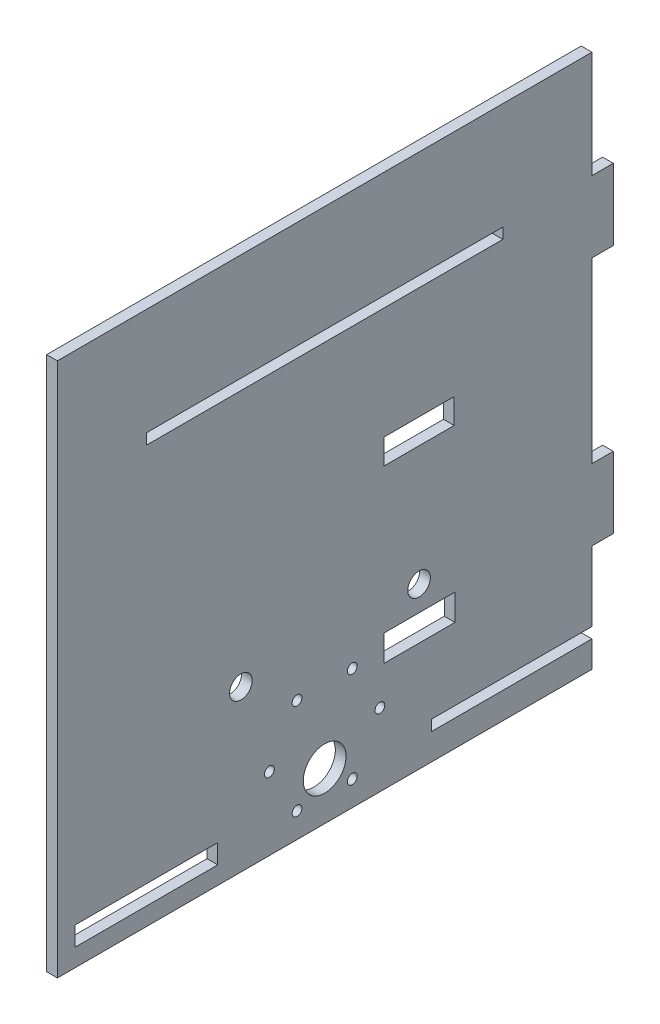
ISO-10303-21;
HEADER;
FILE_DESCRIPTION(('STEP AP214'),'2;1');
FILE_NAME('part.step','',(''),(''),'','','');
FILE_SCHEMA(('AUTOMOTIVE_DESIGN { 1 0 10303 214 1 1 1 1 }'));
ENDSEC;
DATA;
#1=APPLICATION_CONTEXT('core data for automotive mechanical design processes');
#2=APPLICATION_PROTOCOL_DEFINITION('international standard','automotive_design',2000,#1);
#3=PRODUCT_CONTEXT('',#1,'mechanical');
#4=PRODUCT('Part','Part','',(#3));
#5=PRODUCT_RELATED_PRODUCT_CATEGORY('part','',(#4));
#6=PRODUCT_DEFINITION_FORMATION('','',#4);
#7=PRODUCT_DEFINITION_CONTEXT('part definition',#1,'design');
#8=PRODUCT_DEFINITION('design','',#6,#7);
#9=PRODUCT_DEFINITION_SHAPE('','',#8);
#10=(LENGTH_UNIT() NAMED_UNIT(*) SI_UNIT(.MILLI.,.METRE.));
#11=(NAMED_UNIT(*) PLANE_ANGLE_UNIT() SI_UNIT($,.RADIAN.));
#12=(NAMED_UNIT(*) SI_UNIT($,.STERADIAN.) SOLID_ANGLE_UNIT());
#13=UNCERTAINTY_MEASURE_WITH_UNIT(LENGTH_MEASURE(1.E-05),#10,'distance_accuracy_value','');
#14=(GEOMETRIC_REPRESENTATION_CONTEXT(3) GLOBAL_UNCERTAINTY_ASSIGNED_CONTEXT((#13)) GLOBAL_UNIT_ASSIGNED_CONTEXT((#10,
#11,#12)) REPRESENTATION_CONTEXT('',''));
#15=CARTESIAN_POINT('',(0.,0.,0.));
#16=DIRECTION('',(0.,0.,1.));
#17=DIRECTION('',(1.,0.,0.));
#18=AXIS2_PLACEMENT_3D('',#15,#16,#17);
#19=CARTESIAN_POINT('',(3.,75.,-75.));
#20=DIRECTION('',(0.,0.,1.));
#21=DIRECTION('',(1.,0.,0.));
#22=AXIS2_PLACEMENT_3D('',#19,#20,#21);
#23=PLANE('',#22);
#24=DIRECTION('',(0.,1.,0.));
#25=VECTOR('',#24,1.);
#26=CARTESIAN_POINT('',(0.,75.,-75.));
#27=LINE('',#26,#25);
#28=CARTESIAN_POINT('',(0.,-75.,-75.));
#29=VERTEX_POINT('',#28);
#30=CARTESIAN_POINT('',(0.,-67.5950285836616,-75.));
#31=VERTEX_POINT('',#30);
#32=EDGE_CURVE('E504',#29,#31,#27,.T.);
#33=ORIENTED_EDGE('',*,*,#32,.T.);
#34=DIRECTION('',(-1.,0.,0.));
#35=VECTOR('',#34,1.);
#36=CARTESIAN_POINT('',(3.00005,-67.5950285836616,-75.));
#37=LINE('',#36,#35);
#38=CARTESIAN_POINT('',(3.,-67.5950285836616,-75.));
#39=VERTEX_POINT('',#38);
#40=EDGE_CURVE('E309',#39,#31,#37,.T.);
#41=ORIENTED_EDGE('',*,*,#40,.F.);
#42=DIRECTION('',(0.,1.,0.));
#43=VECTOR('',#42,1.);
#44=CARTESIAN_POINT('',(3.,75.,-75.));
#45=LINE('',#44,#43);
#46=CARTESIAN_POINT('',(3.,-75.,-75.));
#47=VERTEX_POINT('',#46);
#48=EDGE_CURVE('E550',#47,#39,#45,.T.);
#49=ORIENTED_EDGE('',*,*,#48,.F.);
#50=DIRECTION('',(-1.,0.,0.));
#51=VECTOR('',#50,1.);
#52=CARTESIAN_POINT('',(3.,-75.,-75.));
#53=LINE('',#52,#51);
#54=EDGE_CURVE('E517',#47,#29,#53,.T.);
#55=ORIENTED_EDGE('',*,*,#54,.T.);
#56=EDGE_LOOP('',(#33,#41,#49,#55));
#57=FACE_BOUND('',#56,.T.);
#58=ADVANCED_FACE('F35',(#57),#23,.F.);
#59=CARTESIAN_POINT('',(3.,-64.5950285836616,-75.));
#60=VERTEX_POINT('',#59);
#61=CARTESIAN_POINT('',(3.,-45.,-75.));
#62=VERTEX_POINT('',#61);
#63=EDGE_CURVE('E554',#60,#62,#45,.T.);
#64=ORIENTED_EDGE('',*,*,#63,.F.);
#65=DIRECTION('',(-1.,0.,0.));
#66=VECTOR('',#65,1.);
#67=CARTESIAN_POINT('',(3.00005,-64.5950285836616,-75.));
#68=LINE('',#67,#66);
#69=CARTESIAN_POINT('',(0.,-64.5950285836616,-75.));
#70=VERTEX_POINT('',#69);
#71=EDGE_CURVE('E311',#60,#70,#68,.T.);
#72=ORIENTED_EDGE('',*,*,#71,.T.);
#73=CARTESIAN_POINT('',(0.,-45.,-75.));
#74=VERTEX_POINT('',#73);
#75=EDGE_CURVE('E487',#70,#74,#27,.T.);
#76=ORIENTED_EDGE('',*,*,#75,.T.);
#77=DIRECTION('',(1.,0.,0.));
#78=VECTOR('',#77,1.);
#79=CARTESIAN_POINT('',(0.,-45.,-75.));
#80=LINE('',#79,#78);
#81=EDGE_CURVE('E446',#74,#62,#80,.T.);
#82=ORIENTED_EDGE('',*,*,#81,.T.);
#83=EDGE_LOOP('',(#64,#72,#76,#82));
#84=FACE_BOUND('',#83,.T.);
#85=ADVANCED_FACE('F600',(#84),#23,.F.);
#86=DIRECTION('',(1.,0.,0.));
#87=VECTOR('',#86,1.);
#88=CARTESIAN_POINT('',(0.,45.,-75.));
#89=LINE('',#88,#87);
#90=CARTESIAN_POINT('',(0.,45.,-75.));
#91=VERTEX_POINT('',#90);
#92=CARTESIAN_POINT('',(3.,45.,-75.));
#93=VERTEX_POINT('',#92);
#94=EDGE_CURVE('E470',#91,#93,#89,.T.);
#95=ORIENTED_EDGE('',*,*,#94,.F.);
#96=CARTESIAN_POINT('',(0.,75.,-75.));
#97=VERTEX_POINT('',#96);
#98=EDGE_CURVE('E473',#91,#97,#27,.T.);
#99=ORIENTED_EDGE('',*,*,#98,.T.);
#100=DIRECTION('',(-1.,0.,0.));
#101=VECTOR('',#100,1.);
#102=CARTESIAN_POINT('',(3.,75.,-75.));
#103=LINE('',#102,#101);
#104=CARTESIAN_POINT('',(3.,75.,-75.));
#105=VERTEX_POINT('',#104);
#106=EDGE_CURVE('E507',#105,#97,#103,.T.);
#107=ORIENTED_EDGE('',*,*,#106,.F.);
#108=EDGE_CURVE('E521',#93,#105,#45,.T.);
#109=ORIENTED_EDGE('',*,*,#108,.F.);
#110=EDGE_LOOP('',(#95,#99,#107,#109));
#111=FACE_BOUND('',#110,.T.);
#112=ADVANCED_FACE('F604',(#111),#23,.F.);
#113=CARTESIAN_POINT('',(3.,-25.,-75.));
#114=VERTEX_POINT('',#113);
#115=CARTESIAN_POINT('',(3.,25.,-75.));
#116=VERTEX_POINT('',#115);
#117=EDGE_CURVE('E488',#114,#116,#45,.T.);
#118=ORIENTED_EDGE('',*,*,#117,.F.);
#119=DIRECTION('',(1.,0.,0.));
#120=VECTOR('',#119,1.);
#121=CARTESIAN_POINT('',(0.,-25.,-75.));
#122=LINE('',#121,#120);
#123=CARTESIAN_POINT('',(0.,-25.,-75.));
#124=VERTEX_POINT('',#123);
#125=EDGE_CURVE('E450',#124,#114,#122,.T.);
#126=ORIENTED_EDGE('',*,*,#125,.F.);
#127=CARTESIAN_POINT('',(0.,25.,-75.));
#128=VERTEX_POINT('',#127);
#129=EDGE_CURVE('E484',#124,#128,#27,.T.);
#130=ORIENTED_EDGE('',*,*,#129,.T.);
#131=DIRECTION('',(1.,0.,0.));
#132=VECTOR('',#131,1.);
#133=CARTESIAN_POINT('',(0.,25.,-75.));
#134=LINE('',#133,#132);
#135=EDGE_CURVE('E477',#128,#116,#134,.T.);
#136=ORIENTED_EDGE('',*,*,#135,.T.);
#137=EDGE_LOOP('',(#118,#126,#130,#136));
#138=FACE_BOUND('',#137,.T.);
#139=ADVANCED_FACE('F37',(#138),#23,.F.);
#140=CARTESIAN_POINT('',(3.,75.,75.));
#141=DIRECTION('',(0.,-1.,0.));
#142=DIRECTION('',(0.,0.,-1.));
#143=AXIS2_PLACEMENT_3D('',#140,#141,#142);
#144=PLANE('',#143);
#145=DIRECTION('',(0.,0.,1.));
#146=VECTOR('',#145,1.);
#147=CARTESIAN_POINT('',(0.,75.,75.));
#148=LINE('',#147,#146);
#149=CARTESIAN_POINT('',(0.,75.,75.));
#150=VERTEX_POINT('',#149);
#151=EDGE_CURVE('E496',#97,#150,#148,.T.);
#152=ORIENTED_EDGE('',*,*,#151,.T.);
#153=DIRECTION('',(-1.,0.,0.));
#154=VECTOR('',#153,1.);
#155=CARTESIAN_POINT('',(3.,75.,75.));
#156=LINE('',#155,#154);
#157=CARTESIAN_POINT('',(3.,75.,75.));
#158=VERTEX_POINT('',#157);
#159=EDGE_CURVE('E511',#158,#150,#156,.T.);
#160=ORIENTED_EDGE('',*,*,#159,.F.);
#161=DIRECTION('',(0.,0.,1.));
#162=VECTOR('',#161,1.);
#163=CARTESIAN_POINT('',(3.,75.,75.));
#164=LINE('',#163,#162);
#165=EDGE_CURVE('E553',#105,#158,#164,.T.);
#166=ORIENTED_EDGE('',*,*,#165,.F.);
#167=ORIENTED_EDGE('',*,*,#106,.T.);
#168=EDGE_LOOP('',(#152,#160,#166,#167));
#169=FACE_BOUND('',#168,.T.);
#170=ADVANCED_FACE('F529',(#169),#144,.F.);
#171=CARTESIAN_POINT('',(3.,75.,75.));
#172=DIRECTION('',(0.,0.,-1.));
#173=DIRECTION('',(-1.,0.,0.));
#174=AXIS2_PLACEMENT_3D('',#171,#172,#173);
#175=PLANE('',#174);
#176=DIRECTION('',(0.,-1.,0.));
#177=VECTOR('',#176,1.);
#178=CARTESIAN_POINT('',(0.,75.,75.));
#179=LINE('',#178,#177);
#180=CARTESIAN_POINT('',(0.,-75.,75.));
#181=VERTEX_POINT('',#180);
#182=EDGE_CURVE('E522',#150,#181,#179,.T.);
#183=ORIENTED_EDGE('',*,*,#182,.T.);
#184=DIRECTION('',(-1.,0.,0.));
#185=VECTOR('',#184,1.);
#186=CARTESIAN_POINT('',(3.,-75.,75.));
#187=LINE('',#186,#185);
#188=CARTESIAN_POINT('',(3.,-75.,75.));
#189=VERTEX_POINT('',#188);
#190=EDGE_CURVE('E514',#189,#181,#187,.T.);
#191=ORIENTED_EDGE('',*,*,#190,.F.);
#192=DIRECTION('',(0.,-1.,0.));
#193=VECTOR('',#192,1.);
#194=CARTESIAN_POINT('',(3.,75.,75.));
#195=LINE('',#194,#193);
#196=EDGE_CURVE('E536',#158,#189,#195,.T.);
#197=ORIENTED_EDGE('',*,*,#196,.F.);
#198=ORIENTED_EDGE('',*,*,#159,.T.);
#199=EDGE_LOOP('',(#183,#191,#197,#198));
#200=FACE_BOUND('',#199,.T.);
#201=ADVANCED_FACE('F535',(#200),#175,.F.);
#202=CARTESIAN_POINT('',(3.,-75.,75.));
#203=DIRECTION('',(0.,1.,0.));
#204=DIRECTION('',(0.,0.,1.));
#205=AXIS2_PLACEMENT_3D('',#202,#203,#204);
#206=PLANE('',#205);
#207=DIRECTION('',(0.,0.,-1.));
#208=VECTOR('',#207,1.);
#209=CARTESIAN_POINT('',(0.,-75.,75.));
#210=LINE('',#209,#208);
#211=EDGE_CURVE('E520',#181,#29,#210,.T.);
#212=ORIENTED_EDGE('',*,*,#211,.T.);
#213=ORIENTED_EDGE('',*,*,#54,.F.);
#214=DIRECTION('',(0.,0.,-1.));
#215=VECTOR('',#214,1.);
#216=CARTESIAN_POINT('',(3.,-75.,75.));
#217=LINE('',#216,#215);
#218=EDGE_CURVE('E494',#189,#47,#217,.T.);
#219=ORIENTED_EDGE('',*,*,#218,.F.);
#220=ORIENTED_EDGE('',*,*,#190,.T.);
#221=EDGE_LOOP('',(#212,#213,#219,#220));
#222=FACE_BOUND('',#221,.T.);
#223=ADVANCED_FACE('F544',(#222),#206,.F.);
#224=CARTESIAN_POINT('',(3.,0.,0.));
#225=DIRECTION('',(1.,0.,0.));
#226=DIRECTION('',(0.,0.,-1.));
#227=AXIS2_PLACEMENT_3D('',#224,#225,#226);
#228=PLANE('',#227);
#229=DIRECTION('',(0.,1.,0.));
#230=VECTOR('',#229,1.);
#231=CARTESIAN_POINT('',(3.,3.60528739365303,-36.3424999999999));
#232=LINE('',#231,#230);
#233=CARTESIAN_POINT('',(3.,3.60528739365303,-36.3424999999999));
#234=VERTEX_POINT('',#233);
#235=CARTESIAN_POINT('',(3.,10.6255094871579,-36.3424999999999));
#236=VERTEX_POINT('',#235);
#237=EDGE_CURVE('E50',#234,#236,#232,.T.);
#238=ORIENTED_EDGE('',*,*,#237,.F.);
#239=DIRECTION('',(0.,0.,-1.));
#240=VECTOR('',#239,1.);
#241=CARTESIAN_POINT('',(3.,3.60528739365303,-36.3424999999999));
#242=LINE('',#241,#240);
#243=CARTESIAN_POINT('',(3.,3.60528739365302,-16.6575));
#244=VERTEX_POINT('',#243);
#245=EDGE_CURVE('E263',#244,#234,#242,.T.);
#246=ORIENTED_EDGE('',*,*,#245,.F.);
#247=DIRECTION('',(0.,-1.,0.));
#248=VECTOR('',#247,1.);
#249=CARTESIAN_POINT('',(3.,3.60528739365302,-16.6575));
#250=LINE('',#249,#248);
#251=CARTESIAN_POINT('',(3.,10.6255094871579,-16.6575));
#252=VERTEX_POINT('',#251);
#253=EDGE_CURVE('E247',#252,#244,#250,.T.);
#254=ORIENTED_EDGE('',*,*,#253,.F.);
#255=DIRECTION('',(0.,0.,1.));
#256=VECTOR('',#255,1.);
#257=CARTESIAN_POINT('',(3.,10.6255094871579,-36.3424999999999));
#258=LINE('',#257,#256);
#259=EDGE_CURVE('E256',#236,#252,#258,.T.);
#260=ORIENTED_EDGE('',*,*,#259,.F.);
#261=EDGE_LOOP('',(#238,#246,#254,#260));
#262=FACE_BOUND('',#261,.T.);
#263=DIRECTION('',(0.,1.,0.));
#264=VECTOR('',#263,1.);
#265=CARTESIAN_POINT('',(3.,-44.3606584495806,-36.5711));
#266=LINE('',#265,#264);
#267=CARTESIAN_POINT('',(3.,-44.3606584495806,-36.5711));
#268=VERTEX_POINT('',#267);
#269=CARTESIAN_POINT('',(3.,-36.9953057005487,-36.5711));
#270=VERTEX_POINT('',#269);
#271=EDGE_CURVE('E270',#268,#270,#266,.T.);
#272=ORIENTED_EDGE('',*,*,#271,.F.);
#273=DIRECTION('',(0.,0.,-1.));
#274=VECTOR('',#273,1.);
#275=CARTESIAN_POINT('',(3.,-44.3606584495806,-36.5711));
#276=LINE('',#275,#274);
#277=CARTESIAN_POINT('',(3.,-44.3606584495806,-16.6575));
#278=VERTEX_POINT('',#277);
#279=EDGE_CURVE('E280',#278,#268,#276,.T.);
#280=ORIENTED_EDGE('',*,*,#279,.F.);
#281=DIRECTION('',(0.,-1.,0.));
#282=VECTOR('',#281,1.);
#283=CARTESIAN_POINT('',(3.,-44.3606584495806,-16.6575));
#284=LINE('',#283,#282);
#285=CARTESIAN_POINT('',(3.,-36.9953057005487,-16.6575));
#286=VERTEX_POINT('',#285);
#287=EDGE_CURVE('E277',#286,#278,#284,.T.);
#288=ORIENTED_EDGE('',*,*,#287,.F.);
#289=DIRECTION('',(0.,0.,1.));
#290=VECTOR('',#289,1.);
#291=CARTESIAN_POINT('',(3.,-36.9953057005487,-36.5711));
#292=LINE('',#291,#290);
#293=EDGE_CURVE('E274',#270,#286,#292,.T.);
#294=ORIENTED_EDGE('',*,*,#293,.F.);
#295=EDGE_LOOP('',(#272,#280,#288,#294));
#296=FACE_BOUND('',#295,.T.);
#297=CARTESIAN_POINT('',(3.,-61.5950410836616,-2.04445914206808E-13));
#298=DIRECTION('',(1.,0.,0.));
#299=DIRECTION('',(0.,0.,-1.));
#300=AXIS2_PLACEMENT_3D('',#297,#298,#299);
#301=CIRCLE('',#300,6.00000000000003);
#302=CARTESIAN_POINT('',(3.,-61.5950410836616,5.99999999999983));
#303=VERTEX_POINT('',#302);
#304=EDGE_CURVE('E295',#303,#303,#301,.T.);
#305=ORIENTED_EDGE('',*,*,#304,.F.);
#306=EDGE_LOOP('',(#305));
#307=FACE_BOUND('',#306,.T.);
#308=DIRECTION('',(0.,0.,-1.));
#309=VECTOR('',#308,1.);
#310=CARTESIAN_POINT('',(3.,-67.5950285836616,0.));
#311=LINE('',#310,#309);
#312=CARTESIAN_POINT('',(3.,-67.5950285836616,-30.0000000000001));
#313=VERTEX_POINT('',#312);
#314=EDGE_CURVE('E317',#313,#39,#311,.T.);
#315=ORIENTED_EDGE('',*,*,#314,.F.);
#316=DIRECTION('',(0.,-1.,0.));
#317=VECTOR('',#316,1.);
#318=CARTESIAN_POINT('',(3.,0.,-30.0000000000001));
#319=LINE('',#318,#317);
#320=CARTESIAN_POINT('',(3.,-64.5950285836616,-30.0000000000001));
#321=VERTEX_POINT('',#320);
#322=EDGE_CURVE('E319',#321,#313,#319,.T.);
#323=ORIENTED_EDGE('',*,*,#322,.F.);
#324=DIRECTION('',(0.,0.,1.));
#325=VECTOR('',#324,1.);
#326=CARTESIAN_POINT('',(3.,-64.5950285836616,0.));
#327=LINE('',#326,#325);
#328=EDGE_CURVE('E308',#60,#321,#327,.T.);
#329=ORIENTED_EDGE('',*,*,#328,.F.);
#330=ORIENTED_EDGE('',*,*,#63,.T.);
#331=DIRECTION('',(0.,0.,-1.));
#332=VECTOR('',#331,1.);
#333=CARTESIAN_POINT('',(3.,-45.,-75.));
#334=LINE('',#333,#332);
#335=CARTESIAN_POINT('',(3.,-45.,-81.));
#336=VERTEX_POINT('',#335);
#337=EDGE_CURVE('E427',#62,#336,#334,.T.);
#338=ORIENTED_EDGE('',*,*,#337,.T.);
#339=DIRECTION('',(0.,1.,0.));
#340=VECTOR('',#339,1.);
#341=CARTESIAN_POINT('',(3.,-45.,-81.));
#342=LINE('',#341,#340);
#343=CARTESIAN_POINT('',(3.,-25.,-81.));
#344=VERTEX_POINT('',#343);
#345=EDGE_CURVE('E441',#336,#344,#342,.T.);
#346=ORIENTED_EDGE('',*,*,#345,.T.);
#347=DIRECTION('',(0.,0.,1.));
#348=VECTOR('',#347,1.);
#349=CARTESIAN_POINT('',(3.,-25.,-75.));
#350=LINE('',#349,#348);
#351=EDGE_CURVE('E432',#344,#114,#350,.T.);
#352=ORIENTED_EDGE('',*,*,#351,.T.);
#353=ORIENTED_EDGE('',*,*,#117,.T.);
#354=DIRECTION('',(0.,0.,-1.));
#355=VECTOR('',#354,1.);
#356=CARTESIAN_POINT('',(3.,25.,-75.));
#357=LINE('',#356,#355);
#358=CARTESIAN_POINT('',(3.,25.,-81.));
#359=VERTEX_POINT('',#358);
#360=EDGE_CURVE('E449',#116,#359,#357,.T.);
#361=ORIENTED_EDGE('',*,*,#360,.T.);
#362=DIRECTION('',(0.,1.,0.));
#363=VECTOR('',#362,1.);
#364=CARTESIAN_POINT('',(3.,45.,-81.));
#365=LINE('',#364,#363);
#366=CARTESIAN_POINT('',(3.,45.,-81.));
#367=VERTEX_POINT('',#366);
#368=EDGE_CURVE('E461',#359,#367,#365,.T.);
#369=ORIENTED_EDGE('',*,*,#368,.T.);
#370=DIRECTION('',(0.,0.,1.));
#371=VECTOR('',#370,1.);
#372=CARTESIAN_POINT('',(3.,45.,-75.));
#373=LINE('',#372,#371);
#374=EDGE_CURVE('E464',#367,#93,#373,.T.);
#375=ORIENTED_EDGE('',*,*,#374,.T.);
#376=ORIENTED_EDGE('',*,*,#108,.T.);
#377=ORIENTED_EDGE('',*,*,#165,.T.);
#378=ORIENTED_EDGE('',*,*,#196,.T.);
#379=ORIENTED_EDGE('',*,*,#218,.T.);
#380=ORIENTED_EDGE('',*,*,#48,.T.);
#381=EDGE_LOOP('',(#315,#323,#329,#330,#338,#346,#352,#353,#361,#369,#375,#376,#377,#378,#379,#380));
#382=FACE_BOUND('',#381,.T.);
#383=DIRECTION('',(0.,1.,0.));
#384=VECTOR('',#383,1.);
#385=CARTESIAN_POINT('',(3.,0.,-50.));
#386=LINE('',#385,#384);
#387=CARTESIAN_POINT('',(3.,41.9999499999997,-50.));
#388=VERTEX_POINT('',#387);
#389=CARTESIAN_POINT('',(3.,44.9999499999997,-50.));
#390=VERTEX_POINT('',#389);
#391=EDGE_CURVE('E348',#388,#390,#386,.T.);
#392=ORIENTED_EDGE('',*,*,#391,.F.);
#393=DIRECTION('',(0.,0.,-1.));
#394=VECTOR('',#393,1.);
#395=CARTESIAN_POINT('',(3.,41.9999499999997,0.));
#396=LINE('',#395,#394);
#397=CARTESIAN_POINT('',(3.,41.9999499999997,50.));
#398=VERTEX_POINT('',#397);
#399=EDGE_CURVE('E335',#398,#388,#396,.T.);
#400=ORIENTED_EDGE('',*,*,#399,.F.);
#401=DIRECTION('',(0.,-1.,0.));
#402=VECTOR('',#401,1.);
#403=CARTESIAN_POINT('',(3.,0.,50.));
#404=LINE('',#403,#402);
#405=CARTESIAN_POINT('',(3.,44.9999499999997,50.));
#406=VERTEX_POINT('',#405);
#407=EDGE_CURVE('E343',#406,#398,#404,.T.);
#408=ORIENTED_EDGE('',*,*,#407,.F.);
#409=DIRECTION('',(0.,0.,1.));
#410=VECTOR('',#409,1.);
#411=CARTESIAN_POINT('',(3.,44.9999499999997,0.));
#412=LINE('',#411,#410);
#413=EDGE_CURVE('E346',#390,#406,#412,.T.);
#414=ORIENTED_EDGE('',*,*,#413,.F.);
#415=EDGE_LOOP('',(#392,#400,#408,#414));
#416=FACE_BOUND('',#415,.T.);
#417=DIRECTION('',(0.,-1.,0.));
#418=VECTOR('',#417,1.);
#419=CARTESIAN_POINT('',(3.,0.,70.));
#420=LINE('',#419,#418);
#421=CARTESIAN_POINT('',(3.,-64.5950410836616,70.));
#422=VERTEX_POINT('',#421);
#423=CARTESIAN_POINT('',(3.,-70.,70.));
#424=VERTEX_POINT('',#423);
#425=EDGE_CURVE('E377',#422,#424,#420,.T.);
#426=ORIENTED_EDGE('',*,*,#425,.F.);
#427=DIRECTION('',(0.,0.,1.));
#428=VECTOR('',#427,1.);
#429=CARTESIAN_POINT('',(3.,-64.5950410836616,0.));
#430=LINE('',#429,#428);
#431=CARTESIAN_POINT('',(3.,-64.5950410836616,30.));
#432=VERTEX_POINT('',#431);
#433=EDGE_CURVE('E364',#432,#422,#430,.T.);
#434=ORIENTED_EDGE('',*,*,#433,.F.);
#435=DIRECTION('',(0.,1.,0.));
#436=VECTOR('',#435,1.);
#437=CARTESIAN_POINT('',(3.,0.,30.));
#438=LINE('',#437,#436);
#439=CARTESIAN_POINT('',(3.,-70.,30.));
#440=VERTEX_POINT('',#439);
#441=EDGE_CURVE('E372',#440,#432,#438,.T.);
#442=ORIENTED_EDGE('',*,*,#441,.F.);
#443=DIRECTION('',(0.,0.,-1.));
#444=VECTOR('',#443,1.);
#445=CARTESIAN_POINT('',(3.,-70.,0.));
#446=LINE('',#445,#444);
#447=EDGE_CURVE('E375',#424,#440,#446,.T.);
#448=ORIENTED_EDGE('',*,*,#447,.F.);
#449=EDGE_LOOP('',(#426,#434,#442,#448));
#450=FACE_BOUND('',#449,.T.);
#451=CARTESIAN_POINT('',(3.,-41.1716348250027,-7.75000000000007));
#452=DIRECTION('',(1.,0.,0.));
#453=DIRECTION('',(0.,0.,-1.));
#454=AXIS2_PLACEMENT_3D('',#451,#452,#453);
#455=CIRCLE('',#454,1.3727040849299);
#456=CARTESIAN_POINT('',(3.,-41.1716348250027,-6.37729591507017));
#457=VERTEX_POINT('',#456);
#458=EDGE_CURVE('E382',#457,#457,#455,.T.);
#459=ORIENTED_EDGE('',*,*,#458,.F.);
#460=EDGE_LOOP('',(#459));
#461=FACE_BOUND('',#460,.T.);
#462=CARTESIAN_POINT('',(3.,-54.5950285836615,-15.5000000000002));
#463=DIRECTION('',(1.,0.,0.));
#464=DIRECTION('',(0.,0.,-1.));
#465=AXIS2_PLACEMENT_3D('',#462,#463,#464);
#466=CIRCLE('',#465,1.37270408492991);
#467=CARTESIAN_POINT('',(3.,-54.5950285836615,-14.1272959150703));
#468=VERTEX_POINT('',#467);
#469=EDGE_CURVE('E388',#468,#468,#466,.T.);
#470=ORIENTED_EDGE('',*,*,#469,.F.);
#471=EDGE_LOOP('',(#470));
#472=FACE_BOUND('',#471,.T.);
#473=CARTESIAN_POINT('',(3.,-68.0184223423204,-7.75000000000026));
#474=DIRECTION('',(1.,0.,0.));
#475=DIRECTION('',(0.,0.,-1.));
#476=AXIS2_PLACEMENT_3D('',#473,#474,#475);
#477=CIRCLE('',#476,1.37270408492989);
#478=CARTESIAN_POINT('',(3.,-68.0184223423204,-6.37729591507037));
#479=VERTEX_POINT('',#478);
#480=EDGE_CURVE('E394',#479,#479,#477,.T.);
#481=ORIENTED_EDGE('',*,*,#480,.F.);
#482=EDGE_LOOP('',(#481));
#483=FACE_BOUND('',#482,.T.);
#484=CARTESIAN_POINT('',(3.,-68.0184223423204,7.74999999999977));
#485=DIRECTION('',(1.,0.,0.));
#486=DIRECTION('',(0.,0.,-1.));
#487=AXIS2_PLACEMENT_3D('',#484,#485,#486);
#488=CIRCLE('',#487,1.37270408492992);
#489=CARTESIAN_POINT('',(3.,-68.0184223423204,9.12270408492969));
#490=VERTEX_POINT('',#489);
#491=EDGE_CURVE('E400',#490,#490,#488,.T.);
#492=ORIENTED_EDGE('',*,*,#491,.F.);
#493=EDGE_LOOP('',(#492));
#494=FACE_BOUND('',#493,.T.);
#495=CARTESIAN_POINT('',(3.,-54.5950285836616,15.4999999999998));
#496=DIRECTION('',(1.,0.,0.));
#497=DIRECTION('',(0.,0.,-1.));
#498=AXIS2_PLACEMENT_3D('',#495,#496,#497);
#499=CIRCLE('',#498,1.37270408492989);
#500=CARTESIAN_POINT('',(3.,-54.5950285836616,16.8727040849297));
#501=VERTEX_POINT('',#500);
#502=EDGE_CURVE('E406',#501,#501,#499,.T.);
#503=ORIENTED_EDGE('',*,*,#502,.F.);
#504=EDGE_LOOP('',(#503));
#505=FACE_BOUND('',#504,.T.);
#506=CARTESIAN_POINT('',(3.,-41.1716348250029,7.74999999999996));
#507=DIRECTION('',(1.,0.,0.));
#508=DIRECTION('',(0.,0.,-1.));
#509=AXIS2_PLACEMENT_3D('',#506,#507,#508);
#510=CIRCLE('',#509,1.37270408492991);
#511=CARTESIAN_POINT('',(3.,-41.1716348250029,9.12270408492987));
#512=VERTEX_POINT('',#511);
#513=EDGE_CURVE('E412',#512,#512,#510,.T.);
#514=ORIENTED_EDGE('',*,*,#513,.F.);
#515=EDGE_LOOP('',(#514));
#516=FACE_BOUND('',#515,.T.);
#517=CARTESIAN_POINT('',(3.,-30.,23.5));
#518=DIRECTION('',(1.,0.,0.));
#519=DIRECTION('',(0.,0.,-1.));
#520=AXIS2_PLACEMENT_3D('',#517,#518,#519);
#521=CIRCLE('',#520,3.175);
#522=CARTESIAN_POINT('',(3.,-30.,26.675));
#523=VERTEX_POINT('',#522);
#524=EDGE_CURVE('E418',#523,#523,#521,.T.);
#525=ORIENTED_EDGE('',*,*,#524,.F.);
#526=EDGE_LOOP('',(#525));
#527=FACE_BOUND('',#526,.T.);
#528=CARTESIAN_POINT('',(3.,-30.,-26.5));
#529=DIRECTION('',(1.,0.,0.));
#530=DIRECTION('',(0.,0.,-1.));
#531=AXIS2_PLACEMENT_3D('',#528,#529,#530);
#532=CIRCLE('',#531,3.175);
#533=CARTESIAN_POINT('',(3.,-30.,-23.325));
#534=VERTEX_POINT('',#533);
#535=EDGE_CURVE('E424',#534,#534,#532,.T.);
#536=ORIENTED_EDGE('',*,*,#535,.F.);
#537=EDGE_LOOP('',(#536));
#538=FACE_BOUND('',#537,.T.);
#539=ADVANCED_FACE('F260',(#262,#296,#307,#382,#416,#450,#461,#472,#483,#494,#505,#516,#527,
#538),#228,.T.);
#540=CARTESIAN_POINT('',(0.,0.,0.));
#541=DIRECTION('',(1.,0.,0.));
#542=DIRECTION('',(0.,0.,-1.));
#543=AXIS2_PLACEMENT_3D('',#540,#541,#542);
#544=PLANE('',#543);
#545=DIRECTION('',(0.,0.,-1.));
#546=VECTOR('',#545,1.);
#547=CARTESIAN_POINT('',(0.,3.60528739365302,0.));
#548=LINE('',#547,#546);
#549=CARTESIAN_POINT('',(0.,3.60528739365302,-16.6575));
#550=VERTEX_POINT('',#549);
#551=CARTESIAN_POINT('',(0.,3.60528739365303,-36.3424999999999));
#552=VERTEX_POINT('',#551);
#553=EDGE_CURVE('E43',#550,#552,#548,.T.);
#554=ORIENTED_EDGE('',*,*,#553,.T.);
#555=DIRECTION('',(0.,1.,0.));
#556=VECTOR('',#555,1.);
#557=CARTESIAN_POINT('',(0.,0.,-36.3424999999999));
#558=LINE('',#557,#556);
#559=CARTESIAN_POINT('',(0.,10.6255094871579,-36.3424999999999));
#560=VERTEX_POINT('',#559);
#561=EDGE_CURVE('E11',#552,#560,#558,.T.);
#562=ORIENTED_EDGE('',*,*,#561,.T.);
#563=DIRECTION('',(0.,0.,1.));
#564=VECTOR('',#563,1.);
#565=CARTESIAN_POINT('',(0.,10.6255094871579,0.));
#566=LINE('',#565,#564);
#567=CARTESIAN_POINT('',(0.,10.6255094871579,-16.6575));
#568=VERTEX_POINT('',#567);
#569=EDGE_CURVE('E577',#560,#568,#566,.T.);
#570=ORIENTED_EDGE('',*,*,#569,.T.);
#571=DIRECTION('',(0.,-1.,0.));
#572=VECTOR('',#571,1.);
#573=CARTESIAN_POINT('',(0.,0.,-16.6575));
#574=LINE('',#573,#572);
#575=EDGE_CURVE('E250',#568,#550,#574,.T.);
#576=ORIENTED_EDGE('',*,*,#575,.T.);
#577=EDGE_LOOP('',(#554,#562,#570,#576));
#578=FACE_BOUND('',#577,.T.);
#579=DIRECTION('',(0.,0.,-1.));
#580=VECTOR('',#579,1.);
#581=CARTESIAN_POINT('',(0.,-44.3606584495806,0.));
#582=LINE('',#581,#580);
#583=CARTESIAN_POINT('',(0.,-44.3606584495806,-16.6575));
#584=VERTEX_POINT('',#583);
#585=CARTESIAN_POINT('',(0.,-44.3606584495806,-36.5711));
#586=VERTEX_POINT('',#585);
#587=EDGE_CURVE('E571',#584,#586,#582,.T.);
#588=ORIENTED_EDGE('',*,*,#587,.T.);
#589=DIRECTION('',(0.,1.,0.));
#590=VECTOR('',#589,1.);
#591=CARTESIAN_POINT('',(0.,0.,-36.5711));
#592=LINE('',#591,#590);
#593=CARTESIAN_POINT('',(0.,-36.9953057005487,-36.5711));
#594=VERTEX_POINT('',#593);
#595=EDGE_CURVE('E574',#586,#594,#592,.T.);
#596=ORIENTED_EDGE('',*,*,#595,.T.);
#597=DIRECTION('',(0.,0.,1.));
#598=VECTOR('',#597,1.);
#599=CARTESIAN_POINT('',(0.,-36.9953057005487,0.));
#600=LINE('',#599,#598);
#601=CARTESIAN_POINT('',(0.,-36.9953057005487,-16.6575));
#602=VERTEX_POINT('',#601);
#603=EDGE_CURVE('E510',#594,#602,#600,.T.);
#604=ORIENTED_EDGE('',*,*,#603,.T.);
#605=DIRECTION('',(0.,-1.,0.));
#606=VECTOR('',#605,1.);
#607=CARTESIAN_POINT('',(0.,0.,-16.6575));
#608=LINE('',#607,#606);
#609=EDGE_CURVE('E568',#602,#584,#608,.T.);
#610=ORIENTED_EDGE('',*,*,#609,.T.);
#611=EDGE_LOOP('',(#588,#596,#604,#610));
#612=FACE_BOUND('',#611,.T.);
#613=CARTESIAN_POINT('',(0.,-61.5950410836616,-2.04445914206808E-13));
#614=DIRECTION('',(-1.,0.,0.));
#615=DIRECTION('',(0.,0.,1.));
#616=AXIS2_PLACEMENT_3D('',#613,#614,#615);
#617=CIRCLE('',#616,6.00000000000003);
#618=CARTESIAN_POINT('',(0.,-61.5950410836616,5.99999999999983));
#619=VERTEX_POINT('',#618);
#620=EDGE_CURVE('E286',#619,#619,#617,.T.);
#621=ORIENTED_EDGE('',*,*,#620,.F.);
#622=EDGE_LOOP('',(#621));
#623=FACE_BOUND('',#622,.T.);
#624=DIRECTION('',(0.,0.,1.));
#625=VECTOR('',#624,1.);
#626=CARTESIAN_POINT('',(0.,41.9999499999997,-50.));
#627=LINE('',#626,#625);
#628=CARTESIAN_POINT('',(0.,41.9999499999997,-50.));
#629=VERTEX_POINT('',#628);
#630=CARTESIAN_POINT('',(0.,41.9999499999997,50.));
#631=VERTEX_POINT('',#630);
#632=EDGE_CURVE('E323',#629,#631,#627,.T.);
#633=ORIENTED_EDGE('',*,*,#632,.F.);
#634=DIRECTION('',(0.,-1.,0.));
#635=VECTOR('',#634,1.);
#636=CARTESIAN_POINT('',(0.,44.9999499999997,-50.));
#637=LINE('',#636,#635);
#638=CARTESIAN_POINT('',(0.,44.9999499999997,-50.));
#639=VERTEX_POINT('',#638);
#640=EDGE_CURVE('E321',#639,#629,#637,.T.);
#641=ORIENTED_EDGE('',*,*,#640,.F.);
#642=DIRECTION('',(0.,0.,-1.));
#643=VECTOR('',#642,1.);
#644=CARTESIAN_POINT('',(0.,44.9999499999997,-50.));
#645=LINE('',#644,#643);
#646=CARTESIAN_POINT('',(0.,44.9999499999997,50.));
#647=VERTEX_POINT('',#646);
#648=EDGE_CURVE('E329',#647,#639,#645,.T.);
#649=ORIENTED_EDGE('',*,*,#648,.F.);
#650=DIRECTION('',(0.,1.,0.));
#651=VECTOR('',#650,1.);
#652=CARTESIAN_POINT('',(0.,44.9999499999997,50.));
#653=LINE('',#652,#651);
#654=EDGE_CURVE('E326',#631,#647,#653,.T.);
#655=ORIENTED_EDGE('',*,*,#654,.F.);
#656=EDGE_LOOP('',(#633,#641,#649,#655));
#657=FACE_BOUND('',#656,.T.);
#658=DIRECTION('',(0.,0.,-1.));
#659=VECTOR('',#658,1.);
#660=CARTESIAN_POINT('',(0.,-64.5950410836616,70.));
#661=LINE('',#660,#659);
#662=CARTESIAN_POINT('',(0.,-64.5950410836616,70.));
#663=VERTEX_POINT('',#662);
#664=CARTESIAN_POINT('',(0.,-64.5950410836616,30.));
#665=VERTEX_POINT('',#664);
#666=EDGE_CURVE('E352',#663,#665,#661,.T.);
#667=ORIENTED_EDGE('',*,*,#666,.F.);
#668=DIRECTION('',(0.,1.,0.));
#669=VECTOR('',#668,1.);
#670=CARTESIAN_POINT('',(0.,-64.5950410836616,70.));
#671=LINE('',#670,#669);
#672=CARTESIAN_POINT('',(0.,-70.,70.));
#673=VERTEX_POINT('',#672);
#674=EDGE_CURVE('E350',#673,#663,#671,.T.);
#675=ORIENTED_EDGE('',*,*,#674,.F.);
#676=DIRECTION('',(0.,0.,1.));
#677=VECTOR('',#676,1.);
#678=CARTESIAN_POINT('',(0.,-70.,70.));
#679=LINE('',#678,#677);
#680=CARTESIAN_POINT('',(0.,-70.,30.));
#681=VERTEX_POINT('',#680);
#682=EDGE_CURVE('E358',#681,#673,#679,.T.);
#683=ORIENTED_EDGE('',*,*,#682,.F.);
#684=DIRECTION('',(0.,-1.,0.));
#685=VECTOR('',#684,1.);
#686=CARTESIAN_POINT('',(0.,-64.5950410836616,30.));
#687=LINE('',#686,#685);
#688=EDGE_CURVE('E355',#665,#681,#687,.T.);
#689=ORIENTED_EDGE('',*,*,#688,.F.);
#690=EDGE_LOOP('',(#667,#675,#683,#689));
#691=FACE_BOUND('',#690,.T.);
#692=CARTESIAN_POINT('',(0.,-41.1716348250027,-7.75000000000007));
#693=DIRECTION('',(-1.,0.,0.));
#694=DIRECTION('',(0.,0.,1.));
#695=AXIS2_PLACEMENT_3D('',#692,#693,#694);
#696=CIRCLE('',#695,1.3727040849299);
#697=CARTESIAN_POINT('',(0.,-41.1716348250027,-6.37729591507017));
#698=VERTEX_POINT('',#697);
#699=EDGE_CURVE('E379',#698,#698,#696,.T.);
#700=ORIENTED_EDGE('',*,*,#699,.F.);
#701=EDGE_LOOP('',(#700));
#702=FACE_BOUND('',#701,.T.);
#703=CARTESIAN_POINT('',(0.,-54.5950285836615,-15.5000000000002));
#704=DIRECTION('',(-1.,0.,0.));
#705=DIRECTION('',(0.,0.,1.));
#706=AXIS2_PLACEMENT_3D('',#703,#704,#705);
#707=CIRCLE('',#706,1.37270408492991);
#708=CARTESIAN_POINT('',(0.,-54.5950285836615,-14.1272959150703));
#709=VERTEX_POINT('',#708);
#710=EDGE_CURVE('E385',#709,#709,#707,.T.);
#711=ORIENTED_EDGE('',*,*,#710,.F.);
#712=EDGE_LOOP('',(#711));
#713=FACE_BOUND('',#712,.T.);
#714=CARTESIAN_POINT('',(0.,-68.0184223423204,-7.75000000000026));
#715=DIRECTION('',(-1.,0.,0.));
#716=DIRECTION('',(0.,0.,1.));
#717=AXIS2_PLACEMENT_3D('',#714,#715,#716);
#718=CIRCLE('',#717,1.37270408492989);
#719=CARTESIAN_POINT('',(0.,-68.0184223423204,-6.37729591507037));
#720=VERTEX_POINT('',#719);
#721=EDGE_CURVE('E391',#720,#720,#718,.T.);
#722=ORIENTED_EDGE('',*,*,#721,.F.);
#723=EDGE_LOOP('',(#722));
#724=FACE_BOUND('',#723,.T.);
#725=CARTESIAN_POINT('',(0.,-68.0184223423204,7.74999999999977));
#726=DIRECTION('',(-1.,0.,0.));
#727=DIRECTION('',(0.,0.,1.));
#728=AXIS2_PLACEMENT_3D('',#725,#726,#727);
#729=CIRCLE('',#728,1.37270408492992);
#730=CARTESIAN_POINT('',(0.,-68.0184223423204,9.12270408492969));
#731=VERTEX_POINT('',#730);
#732=EDGE_CURVE('E397',#731,#731,#729,.T.);
#733=ORIENTED_EDGE('',*,*,#732,.F.);
#734=EDGE_LOOP('',(#733));
#735=FACE_BOUND('',#734,.T.);
#736=CARTESIAN_POINT('',(0.,-54.5950285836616,15.4999999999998));
#737=DIRECTION('',(-1.,0.,0.));
#738=DIRECTION('',(0.,0.,1.));
#739=AXIS2_PLACEMENT_3D('',#736,#737,#738);
#740=CIRCLE('',#739,1.37270408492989);
#741=CARTESIAN_POINT('',(0.,-54.5950285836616,16.8727040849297));
#742=VERTEX_POINT('',#741);
#743=EDGE_CURVE('E403',#742,#742,#740,.T.);
#744=ORIENTED_EDGE('',*,*,#743,.F.);
#745=EDGE_LOOP('',(#744));
#746=FACE_BOUND('',#745,.T.);
#747=CARTESIAN_POINT('',(0.,-41.1716348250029,7.74999999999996));
#748=DIRECTION('',(-1.,0.,0.));
#749=DIRECTION('',(0.,0.,1.));
#750=AXIS2_PLACEMENT_3D('',#747,#748,#749);
#751=CIRCLE('',#750,1.37270408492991);
#752=CARTESIAN_POINT('',(0.,-41.1716348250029,9.12270408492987));
#753=VERTEX_POINT('',#752);
#754=EDGE_CURVE('E409',#753,#753,#751,.T.);
#755=ORIENTED_EDGE('',*,*,#754,.F.);
#756=EDGE_LOOP('',(#755));
#757=FACE_BOUND('',#756,.T.);
#758=CARTESIAN_POINT('',(0.,-30.,23.5));
#759=DIRECTION('',(-1.,0.,0.));
#760=DIRECTION('',(0.,0.,1.));
#761=AXIS2_PLACEMENT_3D('',#758,#759,#760);
#762=CIRCLE('',#761,3.175);
#763=CARTESIAN_POINT('',(0.,-30.,26.675));
#764=VERTEX_POINT('',#763);
#765=EDGE_CURVE('E415',#764,#764,#762,.T.);
#766=ORIENTED_EDGE('',*,*,#765,.F.);
#767=EDGE_LOOP('',(#766));
#768=FACE_BOUND('',#767,.T.);
#769=CARTESIAN_POINT('',(0.,-30.,-26.5));
#770=DIRECTION('',(-1.,0.,0.));
#771=DIRECTION('',(0.,0.,1.));
#772=AXIS2_PLACEMENT_3D('',#769,#770,#771);
#773=CIRCLE('',#772,3.175);
#774=CARTESIAN_POINT('',(0.,-30.,-23.325));
#775=VERTEX_POINT('',#774);
#776=EDGE_CURVE('E421',#775,#775,#773,.T.);
#777=ORIENTED_EDGE('',*,*,#776,.F.);
#778=EDGE_LOOP('',(#777));
#779=FACE_BOUND('',#778,.T.);
#780=DIRECTION('',(0.,1.,0.));
#781=VECTOR('',#780,1.);
#782=CARTESIAN_POINT('',(0.,-67.5950285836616,-30.0000000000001));
#783=LINE('',#782,#781);
#784=CARTESIAN_POINT('',(0.,-67.5950285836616,-30.0000000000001));
#785=VERTEX_POINT('',#784);
#786=CARTESIAN_POINT('',(0.,-64.5950285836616,-30.0000000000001));
#787=VERTEX_POINT('',#786);
#788=EDGE_CURVE('E298',#785,#787,#783,.T.);
#789=ORIENTED_EDGE('',*,*,#788,.F.);
#790=DIRECTION('',(0.,0.,1.));
#791=VECTOR('',#790,1.);
#792=CARTESIAN_POINT('',(0.,-67.5950285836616,-30.0000000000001));
#793=LINE('',#792,#791);
#794=EDGE_CURVE('E302',#31,#785,#793,.T.);
#795=ORIENTED_EDGE('',*,*,#794,.F.);
#796=ORIENTED_EDGE('',*,*,#32,.F.);
#797=ORIENTED_EDGE('',*,*,#211,.F.);
#798=ORIENTED_EDGE('',*,*,#182,.F.);
#799=ORIENTED_EDGE('',*,*,#151,.F.);
#800=ORIENTED_EDGE('',*,*,#98,.F.);
#801=DIRECTION('',(0.,0.,1.));
#802=VECTOR('',#801,1.);
#803=CARTESIAN_POINT('',(0.,45.,-75.));
#804=LINE('',#803,#802);
#805=CARTESIAN_POINT('',(0.,45.,-81.));
#806=VERTEX_POINT('',#805);
#807=EDGE_CURVE('E459',#806,#91,#804,.T.);
#808=ORIENTED_EDGE('',*,*,#807,.F.);
#809=DIRECTION('',(0.,1.,0.));
#810=VECTOR('',#809,1.);
#811=CARTESIAN_POINT('',(0.,45.,-81.));
#812=LINE('',#811,#810);
#813=CARTESIAN_POINT('',(0.,25.,-81.));
#814=VERTEX_POINT('',#813);
#815=EDGE_CURVE('E456',#814,#806,#812,.T.);
#816=ORIENTED_EDGE('',*,*,#815,.F.);
#817=DIRECTION('',(0.,0.,-1.));
#818=VECTOR('',#817,1.);
#819=CARTESIAN_POINT('',(0.,25.,-75.));
#820=LINE('',#819,#818);
#821=EDGE_CURVE('E460',#128,#814,#820,.T.);
#822=ORIENTED_EDGE('',*,*,#821,.F.);
#823=ORIENTED_EDGE('',*,*,#129,.F.);
#824=DIRECTION('',(0.,0.,1.));
#825=VECTOR('',#824,1.);
#826=CARTESIAN_POINT('',(0.,-25.,-75.));
#827=LINE('',#826,#825);
#828=CARTESIAN_POINT('',(0.,-25.,-81.));
#829=VERTEX_POINT('',#828);
#830=EDGE_CURVE('E435',#829,#124,#827,.T.);
#831=ORIENTED_EDGE('',*,*,#830,.F.);
#832=DIRECTION('',(0.,1.,0.));
#833=VECTOR('',#832,1.);
#834=CARTESIAN_POINT('',(0.,-45.,-81.));
#835=LINE('',#834,#833);
#836=CARTESIAN_POINT('',(0.,-45.,-81.));
#837=VERTEX_POINT('',#836);
#838=EDGE_CURVE('E431',#837,#829,#835,.T.);
#839=ORIENTED_EDGE('',*,*,#838,.F.);
#840=DIRECTION('',(0.,0.,-1.));
#841=VECTOR('',#840,1.);
#842=CARTESIAN_POINT('',(0.,-45.,-75.));
#843=LINE('',#842,#841);
#844=EDGE_CURVE('E428',#74,#837,#843,.T.);
#845=ORIENTED_EDGE('',*,*,#844,.F.);
#846=ORIENTED_EDGE('',*,*,#75,.F.);
#847=DIRECTION('',(0.,0.,-1.));
#848=VECTOR('',#847,1.);
#849=CARTESIAN_POINT('',(0.,-64.5950285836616,-30.0000000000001));
#850=LINE('',#849,#848);
#851=EDGE_CURVE('E300',#787,#70,#850,.T.);
#852=ORIENTED_EDGE('',*,*,#851,.F.);
#853=EDGE_LOOP('',(#789,#795,#796,#797,#798,#799,#800,#808,#816,#822,#823,#831,#839,#845,#846,#852));
#854=FACE_BOUND('',#853,.T.);
#855=ADVANCED_FACE('F539',(#578,#612,#623,#657,#691,#702,#713,#724,#735,#746,#757,#768,#779,
#854),#544,.F.);
#856=CARTESIAN_POINT('',(0.,45.,-75.));
#857=DIRECTION('',(0.,1.,0.));
#858=DIRECTION('',(0.,0.,1.));
#859=AXIS2_PLACEMENT_3D('',#856,#857,#858);
#860=PLANE('',#859);
#861=ORIENTED_EDGE('',*,*,#374,.F.);
#862=DIRECTION('',(1.,0.,0.));
#863=VECTOR('',#862,1.);
#864=CARTESIAN_POINT('',(0.,45.,-81.));
#865=LINE('',#864,#863);
#866=EDGE_CURVE('E467',#806,#367,#865,.T.);
#867=ORIENTED_EDGE('',*,*,#866,.F.);
#868=ORIENTED_EDGE('',*,*,#807,.T.);
#869=ORIENTED_EDGE('',*,*,#94,.T.);
#870=EDGE_LOOP('',(#861,#867,#868,#869));
#871=FACE_BOUND('',#870,.T.);
#872=ADVANCED_FACE('F643',(#871),#860,.T.);
#873=CARTESIAN_POINT('',(0.,45.,-81.));
#874=DIRECTION('',(0.,0.,-1.));
#875=DIRECTION('',(-1.,0.,0.));
#876=AXIS2_PLACEMENT_3D('',#873,#874,#875);
#877=PLANE('',#876);
#878=ORIENTED_EDGE('',*,*,#368,.F.);
#879=DIRECTION('',(1.,0.,0.));
#880=VECTOR('',#879,1.);
#881=CARTESIAN_POINT('',(0.,25.,-81.));
#882=LINE('',#881,#880);
#883=EDGE_CURVE('E634',#814,#359,#882,.T.);
#884=ORIENTED_EDGE('',*,*,#883,.F.);
#885=ORIENTED_EDGE('',*,*,#815,.T.);
#886=ORIENTED_EDGE('',*,*,#866,.T.);
#887=EDGE_LOOP('',(#878,#884,#885,#886));
#888=FACE_BOUND('',#887,.T.);
#889=ADVANCED_FACE('F646',(#888),#877,.T.);
#890=CARTESIAN_POINT('',(0.,25.,-75.));
#891=DIRECTION('',(0.,-1.,0.));
#892=DIRECTION('',(0.,0.,-1.));
#893=AXIS2_PLACEMENT_3D('',#890,#891,#892);
#894=PLANE('',#893);
#895=ORIENTED_EDGE('',*,*,#360,.F.);
#896=ORIENTED_EDGE('',*,*,#135,.F.);
#897=ORIENTED_EDGE('',*,*,#821,.T.);
#898=ORIENTED_EDGE('',*,*,#883,.T.);
#899=EDGE_LOOP('',(#895,#896,#897,#898));
#900=FACE_BOUND('',#899,.T.);
#901=ADVANCED_FACE('F633',(#900),#894,.T.);
#902=CARTESIAN_POINT('',(0.,-45.,-75.));
#903=DIRECTION('',(0.,-1.,0.));
#904=DIRECTION('',(0.,0.,-1.));
#905=AXIS2_PLACEMENT_3D('',#902,#903,#904);
#906=PLANE('',#905);
#907=ORIENTED_EDGE('',*,*,#337,.F.);
#908=ORIENTED_EDGE('',*,*,#81,.F.);
#909=ORIENTED_EDGE('',*,*,#844,.T.);
#910=DIRECTION('',(1.,0.,0.));
#911=VECTOR('',#910,1.);
#912=CARTESIAN_POINT('',(0.,-45.,-81.));
#913=LINE('',#912,#911);
#914=EDGE_CURVE('E438',#837,#336,#913,.T.);
#915=ORIENTED_EDGE('',*,*,#914,.T.);
#916=EDGE_LOOP('',(#907,#908,#909,#915));
#917=FACE_BOUND('',#916,.T.);
#918=ADVANCED_FACE('F653',(#917),#906,.T.);
#919=CARTESIAN_POINT('',(0.,-25.,-75.));
#920=DIRECTION('',(0.,1.,0.));
#921=DIRECTION('',(0.,0.,1.));
#922=AXIS2_PLACEMENT_3D('',#919,#920,#921);
#923=PLANE('',#922);
#924=ORIENTED_EDGE('',*,*,#351,.F.);
#925=DIRECTION('',(1.,0.,0.));
#926=VECTOR('',#925,1.);
#927=CARTESIAN_POINT('',(0.,-25.,-81.));
#928=LINE('',#927,#926);
#929=EDGE_CURVE('E453',#829,#344,#928,.T.);
#930=ORIENTED_EDGE('',*,*,#929,.F.);
#931=ORIENTED_EDGE('',*,*,#830,.T.);
#932=ORIENTED_EDGE('',*,*,#125,.T.);
#933=EDGE_LOOP('',(#924,#930,#931,#932));
#934=FACE_BOUND('',#933,.T.);
#935=ADVANCED_FACE('F620',(#934),#923,.T.);
#936=CARTESIAN_POINT('',(0.,-45.,-81.));
#937=DIRECTION('',(0.,0.,-1.));
#938=DIRECTION('',(-1.,0.,0.));
#939=AXIS2_PLACEMENT_3D('',#936,#937,#938);
#940=PLANE('',#939);
#941=ORIENTED_EDGE('',*,*,#345,.F.);
#942=ORIENTED_EDGE('',*,*,#914,.F.);
#943=ORIENTED_EDGE('',*,*,#838,.T.);
#944=ORIENTED_EDGE('',*,*,#929,.T.);
#945=EDGE_LOOP('',(#941,#942,#943,#944));
#946=FACE_BOUND('',#945,.T.);
#947=ADVANCED_FACE('F626',(#946),#940,.T.);
#948=CARTESIAN_POINT('',(3.00005,-30.,-26.5));
#949=DIRECTION('',(-1.,0.,0.));
#950=DIRECTION('',(0.,0.,1.));
#951=AXIS2_PLACEMENT_3D('',#948,#949,#950);
#952=CYLINDRICAL_SURFACE('',#951,3.175);
#953=CARTESIAN_POINT('',(3.,-30.,-23.325));
#954=CARTESIAN_POINT('',(2.96875,-30.,-23.325));
#955=CARTESIAN_POINT('',(2.9375,-30.,-23.325));
#956=CARTESIAN_POINT('',(2.875,-30.,-23.325));
#957=CARTESIAN_POINT('',(2.84375,-30.,-23.325));
#958=CARTESIAN_POINT('',(2.78125,-30.,-23.325));
#959=CARTESIAN_POINT('',(2.75,-30.,-23.325));
#960=CARTESIAN_POINT('',(2.6875,-30.,-23.325));
#961=CARTESIAN_POINT('',(2.65625,-30.,-23.325));
#962=CARTESIAN_POINT('',(2.59375,-30.,-23.325));
#963=CARTESIAN_POINT('',(2.5625,-30.,-23.325));
#964=CARTESIAN_POINT('',(2.5,-30.,-23.325));
#965=CARTESIAN_POINT('',(2.46875,-30.,-23.325));
#966=CARTESIAN_POINT('',(2.40625,-30.,-23.325));
#967=CARTESIAN_POINT('',(2.375,-30.,-23.325));
#968=CARTESIAN_POINT('',(2.3125,-30.,-23.325));
#969=CARTESIAN_POINT('',(2.28125,-30.,-23.325));
#970=CARTESIAN_POINT('',(2.21875,-30.,-23.325));
#971=CARTESIAN_POINT('',(2.1875,-30.,-23.325));
#972=CARTESIAN_POINT('',(2.125,-30.,-23.325));
#973=CARTESIAN_POINT('',(2.09375,-30.,-23.325));
#974=CARTESIAN_POINT('',(2.03125,-30.,-23.325));
#975=CARTESIAN_POINT('',(2.,-30.,-23.325));
#976=CARTESIAN_POINT('',(1.9375,-30.,-23.325));
#977=CARTESIAN_POINT('',(1.90625,-30.,-23.325));
#978=CARTESIAN_POINT('',(1.84375,-30.,-23.325));
#979=CARTESIAN_POINT('',(1.8125,-30.,-23.325));
#980=CARTESIAN_POINT('',(1.75,-30.,-23.325));
#981=CARTESIAN_POINT('',(1.71875,-30.,-23.325));
#982=CARTESIAN_POINT('',(1.65625,-30.,-23.325));
#983=CARTESIAN_POINT('',(1.625,-30.,-23.325));
#984=CARTESIAN_POINT('',(1.5625,-30.,-23.325));
#985=CARTESIAN_POINT('',(1.53125,-30.,-23.325));
#986=CARTESIAN_POINT('',(1.46875,-30.,-23.325));
#987=CARTESIAN_POINT('',(1.4375,-30.,-23.325));
#988=CARTESIAN_POINT('',(1.375,-30.,-23.325));
#989=CARTESIAN_POINT('',(1.34375,-30.,-23.325));
#990=CARTESIAN_POINT('',(1.28125,-30.,-23.325));
#991=CARTESIAN_POINT('',(1.25,-30.,-23.325));
#992=CARTESIAN_POINT('',(1.1875,-30.,-23.325));
#993=CARTESIAN_POINT('',(1.15625,-30.,-23.325));
#994=CARTESIAN_POINT('',(1.09375,-30.,-23.325));
#995=CARTESIAN_POINT('',(1.0625,-30.,-23.325));
#996=CARTESIAN_POINT('',(1.,-30.,-23.325));
#997=CARTESIAN_POINT('',(0.96875,-30.,-23.325));
#998=CARTESIAN_POINT('',(0.90625,-30.,-23.325));
#999=CARTESIAN_POINT('',(0.875,-30.,-23.325));
#1000=CARTESIAN_POINT('',(0.8125,-30.,-23.325));
#1001=CARTESIAN_POINT('',(0.78125,-30.,-23.325));
#1002=CARTESIAN_POINT('',(0.71875,-30.,-23.325));
#1003=CARTESIAN_POINT('',(0.6875,-30.,-23.325));
#1004=CARTESIAN_POINT('',(0.625,-30.,-23.325));
#1005=CARTESIAN_POINT('',(0.59375,-30.,-23.325));
#1006=CARTESIAN_POINT('',(0.53125,-30.,-23.325));
#1007=CARTESIAN_POINT('',(0.5,-30.,-23.325));
#1008=CARTESIAN_POINT('',(0.4375,-30.,-23.325));
#1009=CARTESIAN_POINT('',(0.40625,-30.,-23.325));
#1010=CARTESIAN_POINT('',(0.34375,-30.,-23.325));
#1011=CARTESIAN_POINT('',(0.3125,-30.,-23.325));
#1012=CARTESIAN_POINT('',(0.25,-30.,-23.325));
#1013=CARTESIAN_POINT('',(0.21875,-30.,-23.325));
#1014=CARTESIAN_POINT('',(0.15625,-30.,-23.325));
#1015=CARTESIAN_POINT('',(0.125,-30.,-23.325));
#1016=CARTESIAN_POINT('',(0.0625000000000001,-30.,-23.325));
#1017=CARTESIAN_POINT('',(0.03125,-30.,-23.325));
#1018=CARTESIAN_POINT('',(0.,-30.,-23.325));
#1019=B_SPLINE_CURVE_WITH_KNOTS('',3,(#953,#954,#955,#956,#957,#958,#959,#960,#961,#962,#963,
#964,#965,#966,#967,#968,#969,#970,#971,#972,#973,#974,#975,#976,#977,#978,#979,#980,#981,#982,
#983,#984,#985,#986,#987,#988,#989,#990,#991,#992,#993,#994,#995,#996,#997,#998,#999,#1000,
#1001,#1002,#1003,#1004,#1005,#1006,#1007,#1008,#1009,#1010,#1011,#1012,#1013,#1014,#1015,#1016,
#1017,#1018),.UNSPECIFIED.,.F.,.F.,(4,2,2,2,2,2,2,2,2,2,2,2,2,2,2,2,2,2,2,2,2,2,2,2,2,2,2,2,2,2,
2,2,4),(0.,0.0937499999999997,0.1875,0.28125,0.375,0.46875,0.5625,0.65625,0.75,
0.843749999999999,0.9375,1.03125,1.125,1.21875,1.3125,1.40625,1.5,1.59375,1.6875,1.78125,1.875,
1.96875,2.0625,2.15625,2.25,2.34375,2.4375,2.53125,2.625,2.71875,2.8125,2.90625,3.),.UNSPECIFIED.);
#1020=EDGE_CURVE('BSEAM723',#534,#775,#1019,.T.);
#1021=ORIENTED_EDGE('',*,*,#535,.T.);
#1022=ORIENTED_EDGE('',*,*,#776,.T.);
#1023=ORIENTED_EDGE('',*,*,#1020,.T.);
#1024=ORIENTED_EDGE('',*,*,#1020,.F.);
#1025=EDGE_LOOP('',(#1021,#1023,#1022,#1024));
#1026=FACE_BOUND('',#1025,.T.);
#1027=ADVANCED_FACE('F723',(#1026),#952,.F.);
#1028=CARTESIAN_POINT('',(3.00005,-30.,23.5));
#1029=DIRECTION('',(-1.,0.,0.));
#1030=DIRECTION('',(0.,0.,1.));
#1031=AXIS2_PLACEMENT_3D('',#1028,#1029,#1030);
#1032=CYLINDRICAL_SURFACE('',#1031,3.175);
#1033=CARTESIAN_POINT('',(3.,-30.,26.675));
#1034=CARTESIAN_POINT('',(2.96875,-30.,26.675));
#1035=CARTESIAN_POINT('',(2.9375,-30.,26.675));
#1036=CARTESIAN_POINT('',(2.875,-30.,26.675));
#1037=CARTESIAN_POINT('',(2.84375,-30.,26.675));
#1038=CARTESIAN_POINT('',(2.78125,-30.,26.675));
#1039=CARTESIAN_POINT('',(2.75,-30.,26.675));
#1040=CARTESIAN_POINT('',(2.6875,-30.,26.675));
#1041=CARTESIAN_POINT('',(2.65625,-30.,26.675));
#1042=CARTESIAN_POINT('',(2.59375,-30.,26.675));
#1043=CARTESIAN_POINT('',(2.5625,-30.,26.675));
#1044=CARTESIAN_POINT('',(2.5,-30.,26.675));
#1045=CARTESIAN_POINT('',(2.46875,-30.,26.675));
#1046=CARTESIAN_POINT('',(2.40625,-30.,26.675));
#1047=CARTESIAN_POINT('',(2.375,-30.,26.675));
#1048=CARTESIAN_POINT('',(2.3125,-30.,26.675));
#1049=CARTESIAN_POINT('',(2.28125,-30.,26.675));
#1050=CARTESIAN_POINT('',(2.21875,-30.,26.675));
#1051=CARTESIAN_POINT('',(2.1875,-30.,26.675));
#1052=CARTESIAN_POINT('',(2.125,-30.,26.675));
#1053=CARTESIAN_POINT('',(2.09375,-30.,26.675));
#1054=CARTESIAN_POINT('',(2.03125,-30.,26.675));
#1055=CARTESIAN_POINT('',(2.,-30.,26.675));
#1056=CARTESIAN_POINT('',(1.9375,-30.,26.675));
#1057=CARTESIAN_POINT('',(1.90625,-30.,26.675));
#1058=CARTESIAN_POINT('',(1.84375,-30.,26.675));
#1059=CARTESIAN_POINT('',(1.8125,-30.,26.675));
#1060=CARTESIAN_POINT('',(1.75,-30.,26.675));
#1061=CARTESIAN_POINT('',(1.71875,-30.,26.675));
#1062=CARTESIAN_POINT('',(1.65625,-30.,26.675));
#1063=CARTESIAN_POINT('',(1.625,-30.,26.675));
#1064=CARTESIAN_POINT('',(1.5625,-30.,26.675));
#1065=CARTESIAN_POINT('',(1.53125,-30.,26.675));
#1066=CARTESIAN_POINT('',(1.46875,-30.,26.675));
#1067=CARTESIAN_POINT('',(1.4375,-30.,26.675));
#1068=CARTESIAN_POINT('',(1.375,-30.,26.675));
#1069=CARTESIAN_POINT('',(1.34375,-30.,26.675));
#1070=CARTESIAN_POINT('',(1.28125,-30.,26.675));
#1071=CARTESIAN_POINT('',(1.25,-30.,26.675));
#1072=CARTESIAN_POINT('',(1.1875,-30.,26.675));
#1073=CARTESIAN_POINT('',(1.15625,-30.,26.675));
#1074=CARTESIAN_POINT('',(1.09375,-30.,26.675));
#1075=CARTESIAN_POINT('',(1.0625,-30.,26.675));
#1076=CARTESIAN_POINT('',(1.,-30.,26.675));
#1077=CARTESIAN_POINT('',(0.96875,-30.,26.675));
#1078=CARTESIAN_POINT('',(0.90625,-30.,26.675));
#1079=CARTESIAN_POINT('',(0.875,-30.,26.675));
#1080=CARTESIAN_POINT('',(0.8125,-30.,26.675));
#1081=CARTESIAN_POINT('',(0.78125,-30.,26.675));
#1082=CARTESIAN_POINT('',(0.71875,-30.,26.675));
#1083=CARTESIAN_POINT('',(0.6875,-30.,26.675));
#1084=CARTESIAN_POINT('',(0.625,-30.,26.675));
#1085=CARTESIAN_POINT('',(0.59375,-30.,26.675));
#1086=CARTESIAN_POINT('',(0.53125,-30.,26.675));
#1087=CARTESIAN_POINT('',(0.5,-30.,26.675));
#1088=CARTESIAN_POINT('',(0.4375,-30.,26.675));
#1089=CARTESIAN_POINT('',(0.40625,-30.,26.675));
#1090=CARTESIAN_POINT('',(0.34375,-30.,26.675));
#1091=CARTESIAN_POINT('',(0.3125,-30.,26.675));
#1092=CARTESIAN_POINT('',(0.25,-30.,26.675));
#1093=CARTESIAN_POINT('',(0.21875,-30.,26.675));
#1094=CARTESIAN_POINT('',(0.15625,-30.,26.675));
#1095=CARTESIAN_POINT('',(0.125,-30.,26.675));
#1096=CARTESIAN_POINT('',(0.0625000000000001,-30.,26.675));
#1097=CARTESIAN_POINT('',(0.03125,-30.,26.675));
#1098=CARTESIAN_POINT('',(0.,-30.,26.675));
#1099=B_SPLINE_CURVE_WITH_KNOTS('',3,(#1033,#1034,#1035,#1036,#1037,#1038,#1039,#1040,#1041,
#1042,#1043,#1044,#1045,#1046,#1047,#1048,#1049,#1050,#1051,#1052,#1053,#1054,#1055,#1056,#1057,
#1058,#1059,#1060,#1061,#1062,#1063,#1064,#1065,#1066,#1067,#1068,#1069,#1070,#1071,#1072,#1073,
#1074,#1075,#1076,#1077,#1078,#1079,#1080,#1081,#1082,#1083,#1084,#1085,#1086,#1087,#1088,#1089,
#1090,#1091,#1092,#1093,#1094,#1095,#1096,#1097,#1098),.UNSPECIFIED.,.F.,.F.,(4,2,2,2,2,2,2,2,2,
2,2,2,2,2,2,2,2,2,2,2,2,2,2,2,2,2,2,2,2,2,2,2,4),(0.,0.0937499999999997,0.1875,0.28125,0.375,
0.46875,0.5625,0.65625,0.75,0.843749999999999,0.9375,1.03125,1.125,1.21875,1.3125,1.40625,1.5,
1.59375,1.6875,1.78125,1.875,1.96875,2.0625,2.15625,2.25,2.34375,2.4375,2.53125,2.625,2.71875,
2.8125,2.90625,3.),.UNSPECIFIED.);
#1100=EDGE_CURVE('BSEAM745',#523,#764,#1099,.T.);
#1101=ORIENTED_EDGE('',*,*,#524,.T.);
#1102=ORIENTED_EDGE('',*,*,#765,.T.);
#1103=ORIENTED_EDGE('',*,*,#1100,.T.);
#1104=ORIENTED_EDGE('',*,*,#1100,.F.);
#1105=EDGE_LOOP('',(#1101,#1103,#1102,#1104));
#1106=FACE_BOUND('',#1105,.T.);
#1107=ADVANCED_FACE('F745',(#1106),#1032,.F.);
#1108=CARTESIAN_POINT('',(3.00005,-41.1716348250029,7.74999999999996));
#1109=DIRECTION('',(-1.,0.,0.));
#1110=DIRECTION('',(0.,0.,1.));
#1111=AXIS2_PLACEMENT_3D('',#1108,#1109,#1110);
#1112=CYLINDRICAL_SURFACE('',#1111,1.37270408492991);
#1113=CARTESIAN_POINT('',(3.,-41.1716348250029,9.12270408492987));
#1114=CARTESIAN_POINT('',(2.96875,-41.1716348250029,9.12270408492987));
#1115=CARTESIAN_POINT('',(2.9375,-41.1716348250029,9.12270408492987));
#1116=CARTESIAN_POINT('',(2.875,-41.1716348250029,9.12270408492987));
#1117=CARTESIAN_POINT('',(2.84375,-41.1716348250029,9.12270408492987));
#1118=CARTESIAN_POINT('',(2.78125,-41.1716348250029,9.12270408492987));
#1119=CARTESIAN_POINT('',(2.75,-41.1716348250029,9.12270408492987));
#1120=CARTESIAN_POINT('',(2.6875,-41.1716348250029,9.12270408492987));
#1121=CARTESIAN_POINT('',(2.65625,-41.1716348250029,9.12270408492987));
#1122=CARTESIAN_POINT('',(2.59375,-41.1716348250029,9.12270408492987));
#1123=CARTESIAN_POINT('',(2.5625,-41.1716348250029,9.12270408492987));
#1124=CARTESIAN_POINT('',(2.5,-41.1716348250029,9.12270408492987));
#1125=CARTESIAN_POINT('',(2.46875,-41.1716348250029,9.12270408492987));
#1126=CARTESIAN_POINT('',(2.40625,-41.1716348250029,9.12270408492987));
#1127=CARTESIAN_POINT('',(2.375,-41.1716348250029,9.12270408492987));
#1128=CARTESIAN_POINT('',(2.3125,-41.1716348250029,9.12270408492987));
#1129=CARTESIAN_POINT('',(2.28125,-41.1716348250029,9.12270408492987));
#1130=CARTESIAN_POINT('',(2.21875,-41.1716348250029,9.12270408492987));
#1131=CARTESIAN_POINT('',(2.1875,-41.1716348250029,9.12270408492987));
#1132=CARTESIAN_POINT('',(2.125,-41.1716348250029,9.12270408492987));
#1133=CARTESIAN_POINT('',(2.09375,-41.1716348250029,9.12270408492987));
#1134=CARTESIAN_POINT('',(2.03125,-41.1716348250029,9.12270408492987));
#1135=CARTESIAN_POINT('',(2.,-41.1716348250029,9.12270408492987));
#1136=CARTESIAN_POINT('',(1.9375,-41.1716348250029,9.12270408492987));
#1137=CARTESIAN_POINT('',(1.90625,-41.1716348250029,9.12270408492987));
#1138=CARTESIAN_POINT('',(1.84375,-41.1716348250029,9.12270408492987));
#1139=CARTESIAN_POINT('',(1.8125,-41.1716348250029,9.12270408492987));
#1140=CARTESIAN_POINT('',(1.75,-41.1716348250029,9.12270408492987));
#1141=CARTESIAN_POINT('',(1.71875,-41.1716348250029,9.12270408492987));
#1142=CARTESIAN_POINT('',(1.65625,-41.1716348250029,9.12270408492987));
#1143=CARTESIAN_POINT('',(1.625,-41.1716348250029,9.12270408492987));
#1144=CARTESIAN_POINT('',(1.5625,-41.1716348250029,9.12270408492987));
#1145=CARTESIAN_POINT('',(1.53125,-41.1716348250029,9.12270408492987));
#1146=CARTESIAN_POINT('',(1.46875,-41.1716348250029,9.12270408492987));
#1147=CARTESIAN_POINT('',(1.4375,-41.1716348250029,9.12270408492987));
#1148=CARTESIAN_POINT('',(1.375,-41.1716348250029,9.12270408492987));
#1149=CARTESIAN_POINT('',(1.34375,-41.1716348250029,9.12270408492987));
#1150=CARTESIAN_POINT('',(1.28125,-41.1716348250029,9.12270408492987));
#1151=CARTESIAN_POINT('',(1.25,-41.1716348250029,9.12270408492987));
#1152=CARTESIAN_POINT('',(1.1875,-41.1716348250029,9.12270408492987));
#1153=CARTESIAN_POINT('',(1.15625,-41.1716348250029,9.12270408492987));
#1154=CARTESIAN_POINT('',(1.09375,-41.1716348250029,9.12270408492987));
#1155=CARTESIAN_POINT('',(1.0625,-41.1716348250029,9.12270408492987));
#1156=CARTESIAN_POINT('',(1.,-41.1716348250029,9.12270408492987));
#1157=CARTESIAN_POINT('',(0.96875,-41.1716348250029,9.12270408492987));
#1158=CARTESIAN_POINT('',(0.90625,-41.1716348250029,9.12270408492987));
#1159=CARTESIAN_POINT('',(0.875,-41.1716348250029,9.12270408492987));
#1160=CARTESIAN_POINT('',(0.8125,-41.1716348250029,9.12270408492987));
#1161=CARTESIAN_POINT('',(0.78125,-41.1716348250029,9.12270408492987));
#1162=CARTESIAN_POINT('',(0.71875,-41.1716348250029,9.12270408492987));
#1163=CARTESIAN_POINT('',(0.6875,-41.1716348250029,9.12270408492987));
#1164=CARTESIAN_POINT('',(0.625,-41.1716348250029,9.12270408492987));
#1165=CARTESIAN_POINT('',(0.59375,-41.1716348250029,9.12270408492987));
#1166=CARTESIAN_POINT('',(0.53125,-41.1716348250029,9.12270408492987));
#1167=CARTESIAN_POINT('',(0.5,-41.1716348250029,9.12270408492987));
#1168=CARTESIAN_POINT('',(0.4375,-41.1716348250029,9.12270408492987));
#1169=CARTESIAN_POINT('',(0.40625,-41.1716348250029,9.12270408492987));
#1170=CARTESIAN_POINT('',(0.34375,-41.1716348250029,9.12270408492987));
#1171=CARTESIAN_POINT('',(0.3125,-41.1716348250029,9.12270408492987));
#1172=CARTESIAN_POINT('',(0.25,-41.1716348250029,9.12270408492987));
#1173=CARTESIAN_POINT('',(0.21875,-41.1716348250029,9.12270408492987));
#1174=CARTESIAN_POINT('',(0.15625,-41.1716348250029,9.12270408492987));
#1175=CARTESIAN_POINT('',(0.125,-41.1716348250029,9.12270408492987));
#1176=CARTESIAN_POINT('',(0.0625000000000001,-41.1716348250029,9.12270408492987));
#1177=CARTESIAN_POINT('',(0.03125,-41.1716348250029,9.12270408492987));
#1178=CARTESIAN_POINT('',(0.,-41.1716348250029,9.12270408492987));
#1179=B_SPLINE_CURVE_WITH_KNOTS('',3,(#1113,#1114,#1115,#1116,#1117,#1118,#1119,#1120,#1121,
#1122,#1123,#1124,#1125,#1126,#1127,#1128,#1129,#1130,#1131,#1132,#1133,#1134,#1135,#1136,#1137,
#1138,#1139,#1140,#1141,#1142,#1143,#1144,#1145,#1146,#1147,#1148,#1149,#1150,#1151,#1152,#1153,
#1154,#1155,#1156,#1157,#1158,#1159,#1160,#1161,#1162,#1163,#1164,#1165,#1166,#1167,#1168,#1169,
#1170,#1171,#1172,#1173,#1174,#1175,#1176,#1177,#1178),.UNSPECIFIED.,.F.,.F.,(4,2,2,2,2,2,2,2,2,
2,2,2,2,2,2,2,2,2,2,2,2,2,2,2,2,2,2,2,2,2,2,2,4),(0.,0.0937499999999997,0.1875,0.28125,0.375,
0.46875,0.5625,0.65625,0.75,0.843749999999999,0.9375,1.03125,1.125,1.21875,1.3125,1.40625,1.5,
1.59375,1.6875,1.78125,1.875,1.96875,2.0625,2.15625,2.25,2.34375,2.4375,2.53125,2.625,2.71875,
2.8125,2.90625,3.),.UNSPECIFIED.);
#1180=EDGE_CURVE('BSEAM755',#512,#753,#1179,.T.);
#1181=ORIENTED_EDGE('',*,*,#513,.T.);
#1182=ORIENTED_EDGE('',*,*,#754,.T.);
#1183=ORIENTED_EDGE('',*,*,#1180,.T.);
#1184=ORIENTED_EDGE('',*,*,#1180,.F.);
#1185=EDGE_LOOP('',(#1181,#1183,#1182,#1184));
#1186=FACE_BOUND('',#1185,.T.);
#1187=ADVANCED_FACE('F755',(#1186),#1112,.F.);
#1188=CARTESIAN_POINT('',(3.00005,-54.5950285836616,15.4999999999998));
#1189=DIRECTION('',(-1.,0.,0.));
#1190=DIRECTION('',(0.,0.,1.));
#1191=AXIS2_PLACEMENT_3D('',#1188,#1189,#1190);
#1192=CYLINDRICAL_SURFACE('',#1191,1.37270408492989);
#1193=CARTESIAN_POINT('',(3.,-54.5950285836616,16.8727040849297));
#1194=CARTESIAN_POINT('',(2.96875,-54.5950285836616,16.8727040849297));
#1195=CARTESIAN_POINT('',(2.9375,-54.5950285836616,16.8727040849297));
#1196=CARTESIAN_POINT('',(2.875,-54.5950285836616,16.8727040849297));
#1197=CARTESIAN_POINT('',(2.84375,-54.5950285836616,16.8727040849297));
#1198=CARTESIAN_POINT('',(2.78125,-54.5950285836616,16.8727040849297));
#1199=CARTESIAN_POINT('',(2.75,-54.5950285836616,16.8727040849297));
#1200=CARTESIAN_POINT('',(2.6875,-54.5950285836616,16.8727040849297));
#1201=CARTESIAN_POINT('',(2.65625,-54.5950285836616,16.8727040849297));
#1202=CARTESIAN_POINT('',(2.59375,-54.5950285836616,16.8727040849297));
#1203=CARTESIAN_POINT('',(2.5625,-54.5950285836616,16.8727040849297));
#1204=CARTESIAN_POINT('',(2.5,-54.5950285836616,16.8727040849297));
#1205=CARTESIAN_POINT('',(2.46875,-54.5950285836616,16.8727040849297));
#1206=CARTESIAN_POINT('',(2.40625,-54.5950285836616,16.8727040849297));
#1207=CARTESIAN_POINT('',(2.375,-54.5950285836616,16.8727040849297));
#1208=CARTESIAN_POINT('',(2.3125,-54.5950285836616,16.8727040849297));
#1209=CARTESIAN_POINT('',(2.28125,-54.5950285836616,16.8727040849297));
#1210=CARTESIAN_POINT('',(2.21875,-54.5950285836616,16.8727040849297));
#1211=CARTESIAN_POINT('',(2.1875,-54.5950285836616,16.8727040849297));
#1212=CARTESIAN_POINT('',(2.125,-54.5950285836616,16.8727040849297));
#1213=CARTESIAN_POINT('',(2.09375,-54.5950285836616,16.8727040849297));
#1214=CARTESIAN_POINT('',(2.03125,-54.5950285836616,16.8727040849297));
#1215=CARTESIAN_POINT('',(2.,-54.5950285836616,16.8727040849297));
#1216=CARTESIAN_POINT('',(1.9375,-54.5950285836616,16.8727040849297));
#1217=CARTESIAN_POINT('',(1.90625,-54.5950285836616,16.8727040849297));
#1218=CARTESIAN_POINT('',(1.84375,-54.5950285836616,16.8727040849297));
#1219=CARTESIAN_POINT('',(1.8125,-54.5950285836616,16.8727040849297));
#1220=CARTESIAN_POINT('',(1.75,-54.5950285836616,16.8727040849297));
#1221=CARTESIAN_POINT('',(1.71875,-54.5950285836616,16.8727040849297));
#1222=CARTESIAN_POINT('',(1.65625,-54.5950285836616,16.8727040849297));
#1223=CARTESIAN_POINT('',(1.625,-54.5950285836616,16.8727040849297));
#1224=CARTESIAN_POINT('',(1.5625,-54.5950285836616,16.8727040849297));
#1225=CARTESIAN_POINT('',(1.53125,-54.5950285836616,16.8727040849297));
#1226=CARTESIAN_POINT('',(1.46875,-54.5950285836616,16.8727040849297));
#1227=CARTESIAN_POINT('',(1.4375,-54.5950285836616,16.8727040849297));
#1228=CARTESIAN_POINT('',(1.375,-54.5950285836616,16.8727040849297));
#1229=CARTESIAN_POINT('',(1.34375,-54.5950285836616,16.8727040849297));
#1230=CARTESIAN_POINT('',(1.28125,-54.5950285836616,16.8727040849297));
#1231=CARTESIAN_POINT('',(1.25,-54.5950285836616,16.8727040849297));
#1232=CARTESIAN_POINT('',(1.1875,-54.5950285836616,16.8727040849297));
#1233=CARTESIAN_POINT('',(1.15625,-54.5950285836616,16.8727040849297));
#1234=CARTESIAN_POINT('',(1.09375,-54.5950285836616,16.8727040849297));
#1235=CARTESIAN_POINT('',(1.0625,-54.5950285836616,16.8727040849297));
#1236=CARTESIAN_POINT('',(1.,-54.5950285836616,16.8727040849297));
#1237=CARTESIAN_POINT('',(0.96875,-54.5950285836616,16.8727040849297));
#1238=CARTESIAN_POINT('',(0.90625,-54.5950285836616,16.8727040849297));
#1239=CARTESIAN_POINT('',(0.875,-54.5950285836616,16.8727040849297));
#1240=CARTESIAN_POINT('',(0.8125,-54.5950285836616,16.8727040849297));
#1241=CARTESIAN_POINT('',(0.78125,-54.5950285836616,16.8727040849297));
#1242=CARTESIAN_POINT('',(0.71875,-54.5950285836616,16.8727040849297));
#1243=CARTESIAN_POINT('',(0.6875,-54.5950285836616,16.8727040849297));
#1244=CARTESIAN_POINT('',(0.625,-54.5950285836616,16.8727040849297));
#1245=CARTESIAN_POINT('',(0.59375,-54.5950285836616,16.8727040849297));
#1246=CARTESIAN_POINT('',(0.53125,-54.5950285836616,16.8727040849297));
#1247=CARTESIAN_POINT('',(0.5,-54.5950285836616,16.8727040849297));
#1248=CARTESIAN_POINT('',(0.4375,-54.5950285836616,16.8727040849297));
#1249=CARTESIAN_POINT('',(0.40625,-54.5950285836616,16.8727040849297));
#1250=CARTESIAN_POINT('',(0.34375,-54.5950285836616,16.8727040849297));
#1251=CARTESIAN_POINT('',(0.3125,-54.5950285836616,16.8727040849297));
#1252=CARTESIAN_POINT('',(0.25,-54.5950285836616,16.8727040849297));
#1253=CARTESIAN_POINT('',(0.21875,-54.5950285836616,16.8727040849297));
#1254=CARTESIAN_POINT('',(0.15625,-54.5950285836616,16.8727040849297));
#1255=CARTESIAN_POINT('',(0.125,-54.5950285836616,16.8727040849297));
#1256=CARTESIAN_POINT('',(0.0625000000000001,-54.5950285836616,16.8727040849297));
#1257=CARTESIAN_POINT('',(0.03125,-54.5950285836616,16.8727040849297));
#1258=CARTESIAN_POINT('',(0.,-54.5950285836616,16.8727040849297));
#1259=B_SPLINE_CURVE_WITH_KNOTS('',3,(#1193,#1194,#1195,#1196,#1197,#1198,#1199,#1200,#1201,
#1202,#1203,#1204,#1205,#1206,#1207,#1208,#1209,#1210,#1211,#1212,#1213,#1214,#1215,#1216,#1217,
#1218,#1219,#1220,#1221,#1222,#1223,#1224,#1225,#1226,#1227,#1228,#1229,#1230,#1231,#1232,#1233,
#1234,#1235,#1236,#1237,#1238,#1239,#1240,#1241,#1242,#1243,#1244,#1245,#1246,#1247,#1248,#1249,
#1250,#1251,#1252,#1253,#1254,#1255,#1256,#1257,#1258),.UNSPECIFIED.,.F.,.F.,(4,2,2,2,2,2,2,2,2,
2,2,2,2,2,2,2,2,2,2,2,2,2,2,2,2,2,2,2,2,2,2,2,4),(0.,0.0937499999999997,0.1875,0.28125,0.375,
0.46875,0.5625,0.65625,0.75,0.843749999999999,0.9375,1.03125,1.125,1.21875,1.3125,1.40625,1.5,
1.59375,1.6875,1.78125,1.875,1.96875,2.0625,2.15625,2.25,2.34375,2.4375,2.53125,2.625,2.71875,
2.8125,2.90625,3.),.UNSPECIFIED.);
#1260=EDGE_CURVE('BSEAM765',#501,#742,#1259,.T.);
#1261=ORIENTED_EDGE('',*,*,#502,.T.);
#1262=ORIENTED_EDGE('',*,*,#743,.T.);
#1263=ORIENTED_EDGE('',*,*,#1260,.T.);
#1264=ORIENTED_EDGE('',*,*,#1260,.F.);
#1265=EDGE_LOOP('',(#1261,#1263,#1262,#1264));
#1266=FACE_BOUND('',#1265,.T.);
#1267=ADVANCED_FACE('F765',(#1266),#1192,.F.);
#1268=CARTESIAN_POINT('',(3.00005,-68.0184223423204,7.74999999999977));
#1269=DIRECTION('',(-1.,0.,0.));
#1270=DIRECTION('',(0.,0.,1.));
#1271=AXIS2_PLACEMENT_3D('',#1268,#1269,#1270);
#1272=CYLINDRICAL_SURFACE('',#1271,1.37270408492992);
#1273=CARTESIAN_POINT('',(3.,-68.0184223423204,9.12270408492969));
#1274=CARTESIAN_POINT('',(2.96875,-68.0184223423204,9.12270408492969));
#1275=CARTESIAN_POINT('',(2.9375,-68.0184223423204,9.12270408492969));
#1276=CARTESIAN_POINT('',(2.875,-68.0184223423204,9.12270408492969));
#1277=CARTESIAN_POINT('',(2.84375,-68.0184223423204,9.12270408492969));
#1278=CARTESIAN_POINT('',(2.78125,-68.0184223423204,9.12270408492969));
#1279=CARTESIAN_POINT('',(2.75,-68.0184223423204,9.12270408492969));
#1280=CARTESIAN_POINT('',(2.6875,-68.0184223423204,9.12270408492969));
#1281=CARTESIAN_POINT('',(2.65625,-68.0184223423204,9.12270408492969));
#1282=CARTESIAN_POINT('',(2.59375,-68.0184223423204,9.12270408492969));
#1283=CARTESIAN_POINT('',(2.5625,-68.0184223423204,9.12270408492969));
#1284=CARTESIAN_POINT('',(2.5,-68.0184223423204,9.12270408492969));
#1285=CARTESIAN_POINT('',(2.46875,-68.0184223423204,9.12270408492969));
#1286=CARTESIAN_POINT('',(2.40625,-68.0184223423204,9.12270408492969));
#1287=CARTESIAN_POINT('',(2.375,-68.0184223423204,9.12270408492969));
#1288=CARTESIAN_POINT('',(2.3125,-68.0184223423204,9.12270408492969));
#1289=CARTESIAN_POINT('',(2.28125,-68.0184223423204,9.12270408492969));
#1290=CARTESIAN_POINT('',(2.21875,-68.0184223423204,9.12270408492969));
#1291=CARTESIAN_POINT('',(2.1875,-68.0184223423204,9.12270408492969));
#1292=CARTESIAN_POINT('',(2.125,-68.0184223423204,9.12270408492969));
#1293=CARTESIAN_POINT('',(2.09375,-68.0184223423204,9.12270408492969));
#1294=CARTESIAN_POINT('',(2.03125,-68.0184223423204,9.12270408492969));
#1295=CARTESIAN_POINT('',(2.,-68.0184223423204,9.12270408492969));
#1296=CARTESIAN_POINT('',(1.9375,-68.0184223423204,9.12270408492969));
#1297=CARTESIAN_POINT('',(1.90625,-68.0184223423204,9.12270408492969));
#1298=CARTESIAN_POINT('',(1.84375,-68.0184223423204,9.12270408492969));
#1299=CARTESIAN_POINT('',(1.8125,-68.0184223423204,9.12270408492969));
#1300=CARTESIAN_POINT('',(1.75,-68.0184223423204,9.12270408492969));
#1301=CARTESIAN_POINT('',(1.71875,-68.0184223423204,9.12270408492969));
#1302=CARTESIAN_POINT('',(1.65625,-68.0184223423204,9.12270408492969));
#1303=CARTESIAN_POINT('',(1.625,-68.0184223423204,9.12270408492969));
#1304=CARTESIAN_POINT('',(1.5625,-68.0184223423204,9.12270408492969));
#1305=CARTESIAN_POINT('',(1.53125,-68.0184223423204,9.12270408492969));
#1306=CARTESIAN_POINT('',(1.46875,-68.0184223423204,9.12270408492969));
#1307=CARTESIAN_POINT('',(1.4375,-68.0184223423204,9.12270408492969));
#1308=CARTESIAN_POINT('',(1.375,-68.0184223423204,9.12270408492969));
#1309=CARTESIAN_POINT('',(1.34375,-68.0184223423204,9.12270408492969));
#1310=CARTESIAN_POINT('',(1.28125,-68.0184223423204,9.12270408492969));
#1311=CARTESIAN_POINT('',(1.25,-68.0184223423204,9.12270408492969));
#1312=CARTESIAN_POINT('',(1.1875,-68.0184223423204,9.12270408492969));
#1313=CARTESIAN_POINT('',(1.15625,-68.0184223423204,9.12270408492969));
#1314=CARTESIAN_POINT('',(1.09375,-68.0184223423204,9.12270408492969));
#1315=CARTESIAN_POINT('',(1.0625,-68.0184223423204,9.12270408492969));
#1316=CARTESIAN_POINT('',(1.,-68.0184223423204,9.12270408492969));
#1317=CARTESIAN_POINT('',(0.96875,-68.0184223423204,9.12270408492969));
#1318=CARTESIAN_POINT('',(0.90625,-68.0184223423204,9.12270408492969));
#1319=CARTESIAN_POINT('',(0.875,-68.0184223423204,9.12270408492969));
#1320=CARTESIAN_POINT('',(0.8125,-68.0184223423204,9.12270408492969));
#1321=CARTESIAN_POINT('',(0.78125,-68.0184223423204,9.12270408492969));
#1322=CARTESIAN_POINT('',(0.71875,-68.0184223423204,9.12270408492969));
#1323=CARTESIAN_POINT('',(0.6875,-68.0184223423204,9.12270408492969));
#1324=CARTESIAN_POINT('',(0.625,-68.0184223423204,9.12270408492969));
#1325=CARTESIAN_POINT('',(0.59375,-68.0184223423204,9.12270408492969));
#1326=CARTESIAN_POINT('',(0.53125,-68.0184223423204,9.12270408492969));
#1327=CARTESIAN_POINT('',(0.5,-68.0184223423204,9.12270408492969));
#1328=CARTESIAN_POINT('',(0.4375,-68.0184223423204,9.12270408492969));
#1329=CARTESIAN_POINT('',(0.40625,-68.0184223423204,9.12270408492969));
#1330=CARTESIAN_POINT('',(0.34375,-68.0184223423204,9.12270408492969));
#1331=CARTESIAN_POINT('',(0.3125,-68.0184223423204,9.12270408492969));
#1332=CARTESIAN_POINT('',(0.25,-68.0184223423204,9.12270408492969));
#1333=CARTESIAN_POINT('',(0.21875,-68.0184223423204,9.12270408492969));
#1334=CARTESIAN_POINT('',(0.15625,-68.0184223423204,9.12270408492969));
#1335=CARTESIAN_POINT('',(0.125,-68.0184223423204,9.12270408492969));
#1336=CARTESIAN_POINT('',(0.0625000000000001,-68.0184223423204,9.12270408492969));
#1337=CARTESIAN_POINT('',(0.03125,-68.0184223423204,9.12270408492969));
#1338=CARTESIAN_POINT('',(0.,-68.0184223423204,9.12270408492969));
#1339=B_SPLINE_CURVE_WITH_KNOTS('',3,(#1273,#1274,#1275,#1276,#1277,#1278,#1279,#1280,#1281,
#1282,#1283,#1284,#1285,#1286,#1287,#1288,#1289,#1290,#1291,#1292,#1293,#1294,#1295,#1296,#1297,
#1298,#1299,#1300,#1301,#1302,#1303,#1304,#1305,#1306,#1307,#1308,#1309,#1310,#1311,#1312,#1313,
#1314,#1315,#1316,#1317,#1318,#1319,#1320,#1321,#1322,#1323,#1324,#1325,#1326,#1327,#1328,#1329,
#1330,#1331,#1332,#1333,#1334,#1335,#1336,#1337,#1338),.UNSPECIFIED.,.F.,.F.,(4,2,2,2,2,2,2,2,2,
2,2,2,2,2,2,2,2,2,2,2,2,2,2,2,2,2,2,2,2,2,2,2,4),(0.,0.0937499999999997,0.1875,0.28125,0.375,
0.46875,0.5625,0.65625,0.75,0.843749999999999,0.9375,1.03125,1.125,1.21875,1.3125,1.40625,1.5,
1.59375,1.6875,1.78125,1.875,1.96875,2.0625,2.15625,2.25,2.34375,2.4375,2.53125,2.625,2.71875,
2.8125,2.90625,3.),.UNSPECIFIED.);
#1340=EDGE_CURVE('BSEAM775',#490,#731,#1339,.T.);
#1341=ORIENTED_EDGE('',*,*,#491,.T.);
#1342=ORIENTED_EDGE('',*,*,#732,.T.);
#1343=ORIENTED_EDGE('',*,*,#1340,.T.);
#1344=ORIENTED_EDGE('',*,*,#1340,.F.);
#1345=EDGE_LOOP('',(#1341,#1343,#1342,#1344));
#1346=FACE_BOUND('',#1345,.T.);
#1347=ADVANCED_FACE('F775',(#1346),#1272,.F.);
#1348=CARTESIAN_POINT('',(3.00005,-68.0184223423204,-7.75000000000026));
#1349=DIRECTION('',(-1.,0.,0.));
#1350=DIRECTION('',(0.,0.,1.));
#1351=AXIS2_PLACEMENT_3D('',#1348,#1349,#1350);
#1352=CYLINDRICAL_SURFACE('',#1351,1.37270408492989);
#1353=CARTESIAN_POINT('',(3.,-68.0184223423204,-6.37729591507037));
#1354=CARTESIAN_POINT('',(2.96875,-68.0184223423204,-6.37729591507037));
#1355=CARTESIAN_POINT('',(2.9375,-68.0184223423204,-6.37729591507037));
#1356=CARTESIAN_POINT('',(2.875,-68.0184223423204,-6.37729591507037));
#1357=CARTESIAN_POINT('',(2.84375,-68.0184223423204,-6.37729591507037));
#1358=CARTESIAN_POINT('',(2.78125,-68.0184223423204,-6.37729591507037));
#1359=CARTESIAN_POINT('',(2.75,-68.0184223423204,-6.37729591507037));
#1360=CARTESIAN_POINT('',(2.6875,-68.0184223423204,-6.37729591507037));
#1361=CARTESIAN_POINT('',(2.65625,-68.0184223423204,-6.37729591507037));
#1362=CARTESIAN_POINT('',(2.59375,-68.0184223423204,-6.37729591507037));
#1363=CARTESIAN_POINT('',(2.5625,-68.0184223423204,-6.37729591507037));
#1364=CARTESIAN_POINT('',(2.5,-68.0184223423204,-6.37729591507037));
#1365=CARTESIAN_POINT('',(2.46875,-68.0184223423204,-6.37729591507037));
#1366=CARTESIAN_POINT('',(2.40625,-68.0184223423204,-6.37729591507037));
#1367=CARTESIAN_POINT('',(2.375,-68.0184223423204,-6.37729591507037));
#1368=CARTESIAN_POINT('',(2.3125,-68.0184223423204,-6.37729591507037));
#1369=CARTESIAN_POINT('',(2.28125,-68.0184223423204,-6.37729591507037));
#1370=CARTESIAN_POINT('',(2.21875,-68.0184223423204,-6.37729591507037));
#1371=CARTESIAN_POINT('',(2.1875,-68.0184223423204,-6.37729591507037));
#1372=CARTESIAN_POINT('',(2.125,-68.0184223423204,-6.37729591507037));
#1373=CARTESIAN_POINT('',(2.09375,-68.0184223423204,-6.37729591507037));
#1374=CARTESIAN_POINT('',(2.03125,-68.0184223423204,-6.37729591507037));
#1375=CARTESIAN_POINT('',(2.,-68.0184223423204,-6.37729591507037));
#1376=CARTESIAN_POINT('',(1.9375,-68.0184223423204,-6.37729591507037));
#1377=CARTESIAN_POINT('',(1.90625,-68.0184223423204,-6.37729591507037));
#1378=CARTESIAN_POINT('',(1.84375,-68.0184223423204,-6.37729591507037));
#1379=CARTESIAN_POINT('',(1.8125,-68.0184223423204,-6.37729591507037));
#1380=CARTESIAN_POINT('',(1.75,-68.0184223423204,-6.37729591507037));
#1381=CARTESIAN_POINT('',(1.71875,-68.0184223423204,-6.37729591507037));
#1382=CARTESIAN_POINT('',(1.65625,-68.0184223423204,-6.37729591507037));
#1383=CARTESIAN_POINT('',(1.625,-68.0184223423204,-6.37729591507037));
#1384=CARTESIAN_POINT('',(1.5625,-68.0184223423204,-6.37729591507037));
#1385=CARTESIAN_POINT('',(1.53125,-68.0184223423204,-6.37729591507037));
#1386=CARTESIAN_POINT('',(1.46875,-68.0184223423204,-6.37729591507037));
#1387=CARTESIAN_POINT('',(1.4375,-68.0184223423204,-6.37729591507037));
#1388=CARTESIAN_POINT('',(1.375,-68.0184223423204,-6.37729591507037));
#1389=CARTESIAN_POINT('',(1.34375,-68.0184223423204,-6.37729591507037));
#1390=CARTESIAN_POINT('',(1.28125,-68.0184223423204,-6.37729591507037));
#1391=CARTESIAN_POINT('',(1.25,-68.0184223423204,-6.37729591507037));
#1392=CARTESIAN_POINT('',(1.1875,-68.0184223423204,-6.37729591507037));
#1393=CARTESIAN_POINT('',(1.15625,-68.0184223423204,-6.37729591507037));
#1394=CARTESIAN_POINT('',(1.09375,-68.0184223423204,-6.37729591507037));
#1395=CARTESIAN_POINT('',(1.0625,-68.0184223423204,-6.37729591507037));
#1396=CARTESIAN_POINT('',(1.,-68.0184223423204,-6.37729591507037));
#1397=CARTESIAN_POINT('',(0.96875,-68.0184223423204,-6.37729591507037));
#1398=CARTESIAN_POINT('',(0.90625,-68.0184223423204,-6.37729591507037));
#1399=CARTESIAN_POINT('',(0.875,-68.0184223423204,-6.37729591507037));
#1400=CARTESIAN_POINT('',(0.8125,-68.0184223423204,-6.37729591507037));
#1401=CARTESIAN_POINT('',(0.78125,-68.0184223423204,-6.37729591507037));
#1402=CARTESIAN_POINT('',(0.71875,-68.0184223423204,-6.37729591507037));
#1403=CARTESIAN_POINT('',(0.6875,-68.0184223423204,-6.37729591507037));
#1404=CARTESIAN_POINT('',(0.625,-68.0184223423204,-6.37729591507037));
#1405=CARTESIAN_POINT('',(0.59375,-68.0184223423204,-6.37729591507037));
#1406=CARTESIAN_POINT('',(0.53125,-68.0184223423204,-6.37729591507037));
#1407=CARTESIAN_POINT('',(0.5,-68.0184223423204,-6.37729591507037));
#1408=CARTESIAN_POINT('',(0.4375,-68.0184223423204,-6.37729591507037));
#1409=CARTESIAN_POINT('',(0.40625,-68.0184223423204,-6.37729591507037));
#1410=CARTESIAN_POINT('',(0.34375,-68.0184223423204,-6.37729591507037));
#1411=CARTESIAN_POINT('',(0.3125,-68.0184223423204,-6.37729591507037));
#1412=CARTESIAN_POINT('',(0.25,-68.0184223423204,-6.37729591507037));
#1413=CARTESIAN_POINT('',(0.21875,-68.0184223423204,-6.37729591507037));
#1414=CARTESIAN_POINT('',(0.15625,-68.0184223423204,-6.37729591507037));
#1415=CARTESIAN_POINT('',(0.125,-68.0184223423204,-6.37729591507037));
#1416=CARTESIAN_POINT('',(0.0625000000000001,-68.0184223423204,-6.37729591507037));
#1417=CARTESIAN_POINT('',(0.03125,-68.0184223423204,-6.37729591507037));
#1418=CARTESIAN_POINT('',(0.,-68.0184223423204,-6.37729591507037));
#1419=B_SPLINE_CURVE_WITH_KNOTS('',3,(#1353,#1354,#1355,#1356,#1357,#1358,#1359,#1360,#1361,
#1362,#1363,#1364,#1365,#1366,#1367,#1368,#1369,#1370,#1371,#1372,#1373,#1374,#1375,#1376,#1377,
#1378,#1379,#1380,#1381,#1382,#1383,#1384,#1385,#1386,#1387,#1388,#1389,#1390,#1391,#1392,#1393,
#1394,#1395,#1396,#1397,#1398,#1399,#1400,#1401,#1402,#1403,#1404,#1405,#1406,#1407,#1408,#1409,
#1410,#1411,#1412,#1413,#1414,#1415,#1416,#1417,#1418),.UNSPECIFIED.,.F.,.F.,(4,2,2,2,2,2,2,2,2,
2,2,2,2,2,2,2,2,2,2,2,2,2,2,2,2,2,2,2,2,2,2,2,4),(0.,0.0937499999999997,0.1875,0.28125,0.375,
0.46875,0.5625,0.65625,0.75,0.843749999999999,0.9375,1.03125,1.125,1.21875,1.3125,1.40625,1.5,
1.59375,1.6875,1.78125,1.875,1.96875,2.0625,2.15625,2.25,2.34375,2.4375,2.53125,2.625,2.71875,
2.8125,2.90625,3.),.UNSPECIFIED.);
#1420=EDGE_CURVE('BSEAM785',#479,#720,#1419,.T.);
#1421=ORIENTED_EDGE('',*,*,#480,.T.);
#1422=ORIENTED_EDGE('',*,*,#721,.T.);
#1423=ORIENTED_EDGE('',*,*,#1420,.T.);
#1424=ORIENTED_EDGE('',*,*,#1420,.F.);
#1425=EDGE_LOOP('',(#1421,#1423,#1422,#1424));
#1426=FACE_BOUND('',#1425,.T.);
#1427=ADVANCED_FACE('F785',(#1426),#1352,.F.);
#1428=CARTESIAN_POINT('',(3.00005,-54.5950285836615,-15.5000000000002));
#1429=DIRECTION('',(-1.,0.,0.));
#1430=DIRECTION('',(0.,0.,1.));
#1431=AXIS2_PLACEMENT_3D('',#1428,#1429,#1430);
#1432=CYLINDRICAL_SURFACE('',#1431,1.37270408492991);
#1433=CARTESIAN_POINT('',(3.,-54.5950285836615,-14.1272959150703));
#1434=CARTESIAN_POINT('',(2.96875,-54.5950285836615,-14.1272959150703));
#1435=CARTESIAN_POINT('',(2.9375,-54.5950285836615,-14.1272959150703));
#1436=CARTESIAN_POINT('',(2.875,-54.5950285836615,-14.1272959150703));
#1437=CARTESIAN_POINT('',(2.84375,-54.5950285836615,-14.1272959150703));
#1438=CARTESIAN_POINT('',(2.78125,-54.5950285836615,-14.1272959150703));
#1439=CARTESIAN_POINT('',(2.75,-54.5950285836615,-14.1272959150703));
#1440=CARTESIAN_POINT('',(2.6875,-54.5950285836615,-14.1272959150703));
#1441=CARTESIAN_POINT('',(2.65625,-54.5950285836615,-14.1272959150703));
#1442=CARTESIAN_POINT('',(2.59375,-54.5950285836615,-14.1272959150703));
#1443=CARTESIAN_POINT('',(2.5625,-54.5950285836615,-14.1272959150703));
#1444=CARTESIAN_POINT('',(2.5,-54.5950285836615,-14.1272959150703));
#1445=CARTESIAN_POINT('',(2.46875,-54.5950285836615,-14.1272959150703));
#1446=CARTESIAN_POINT('',(2.40625,-54.5950285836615,-14.1272959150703));
#1447=CARTESIAN_POINT('',(2.375,-54.5950285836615,-14.1272959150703));
#1448=CARTESIAN_POINT('',(2.3125,-54.5950285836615,-14.1272959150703));
#1449=CARTESIAN_POINT('',(2.28125,-54.5950285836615,-14.1272959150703));
#1450=CARTESIAN_POINT('',(2.21875,-54.5950285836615,-14.1272959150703));
#1451=CARTESIAN_POINT('',(2.1875,-54.5950285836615,-14.1272959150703));
#1452=CARTESIAN_POINT('',(2.125,-54.5950285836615,-14.1272959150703));
#1453=CARTESIAN_POINT('',(2.09375,-54.5950285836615,-14.1272959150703));
#1454=CARTESIAN_POINT('',(2.03125,-54.5950285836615,-14.1272959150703));
#1455=CARTESIAN_POINT('',(2.,-54.5950285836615,-14.1272959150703));
#1456=CARTESIAN_POINT('',(1.9375,-54.5950285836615,-14.1272959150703));
#1457=CARTESIAN_POINT('',(1.90625,-54.5950285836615,-14.1272959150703));
#1458=CARTESIAN_POINT('',(1.84375,-54.5950285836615,-14.1272959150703));
#1459=CARTESIAN_POINT('',(1.8125,-54.5950285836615,-14.1272959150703));
#1460=CARTESIAN_POINT('',(1.75,-54.5950285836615,-14.1272959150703));
#1461=CARTESIAN_POINT('',(1.71875,-54.5950285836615,-14.1272959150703));
#1462=CARTESIAN_POINT('',(1.65625,-54.5950285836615,-14.1272959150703));
#1463=CARTESIAN_POINT('',(1.625,-54.5950285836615,-14.1272959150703));
#1464=CARTESIAN_POINT('',(1.5625,-54.5950285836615,-14.1272959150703));
#1465=CARTESIAN_POINT('',(1.53125,-54.5950285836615,-14.1272959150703));
#1466=CARTESIAN_POINT('',(1.46875,-54.5950285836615,-14.1272959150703));
#1467=CARTESIAN_POINT('',(1.4375,-54.5950285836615,-14.1272959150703));
#1468=CARTESIAN_POINT('',(1.375,-54.5950285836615,-14.1272959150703));
#1469=CARTESIAN_POINT('',(1.34375,-54.5950285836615,-14.1272959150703));
#1470=CARTESIAN_POINT('',(1.28125,-54.5950285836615,-14.1272959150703));
#1471=CARTESIAN_POINT('',(1.25,-54.5950285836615,-14.1272959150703));
#1472=CARTESIAN_POINT('',(1.1875,-54.5950285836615,-14.1272959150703));
#1473=CARTESIAN_POINT('',(1.15625,-54.5950285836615,-14.1272959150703));
#1474=CARTESIAN_POINT('',(1.09375,-54.5950285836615,-14.1272959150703));
#1475=CARTESIAN_POINT('',(1.0625,-54.5950285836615,-14.1272959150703));
#1476=CARTESIAN_POINT('',(1.,-54.5950285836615,-14.1272959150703));
#1477=CARTESIAN_POINT('',(0.96875,-54.5950285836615,-14.1272959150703));
#1478=CARTESIAN_POINT('',(0.90625,-54.5950285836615,-14.1272959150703));
#1479=CARTESIAN_POINT('',(0.875,-54.5950285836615,-14.1272959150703));
#1480=CARTESIAN_POINT('',(0.8125,-54.5950285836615,-14.1272959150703));
#1481=CARTESIAN_POINT('',(0.78125,-54.5950285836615,-14.1272959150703));
#1482=CARTESIAN_POINT('',(0.71875,-54.5950285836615,-14.1272959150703));
#1483=CARTESIAN_POINT('',(0.6875,-54.5950285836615,-14.1272959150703));
#1484=CARTESIAN_POINT('',(0.625,-54.5950285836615,-14.1272959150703));
#1485=CARTESIAN_POINT('',(0.59375,-54.5950285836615,-14.1272959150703));
#1486=CARTESIAN_POINT('',(0.53125,-54.5950285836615,-14.1272959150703));
#1487=CARTESIAN_POINT('',(0.5,-54.5950285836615,-14.1272959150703));
#1488=CARTESIAN_POINT('',(0.4375,-54.5950285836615,-14.1272959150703));
#1489=CARTESIAN_POINT('',(0.40625,-54.5950285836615,-14.1272959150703));
#1490=CARTESIAN_POINT('',(0.34375,-54.5950285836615,-14.1272959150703));
#1491=CARTESIAN_POINT('',(0.3125,-54.5950285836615,-14.1272959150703));
#1492=CARTESIAN_POINT('',(0.25,-54.5950285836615,-14.1272959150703));
#1493=CARTESIAN_POINT('',(0.21875,-54.5950285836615,-14.1272959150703));
#1494=CARTESIAN_POINT('',(0.15625,-54.5950285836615,-14.1272959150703));
#1495=CARTESIAN_POINT('',(0.125,-54.5950285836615,-14.1272959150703));
#1496=CARTESIAN_POINT('',(0.0625000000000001,-54.5950285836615,-14.1272959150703));
#1497=CARTESIAN_POINT('',(0.03125,-54.5950285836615,-14.1272959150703));
#1498=CARTESIAN_POINT('',(0.,-54.5950285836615,-14.1272959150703));
#1499=B_SPLINE_CURVE_WITH_KNOTS('',3,(#1433,#1434,#1435,#1436,#1437,#1438,#1439,#1440,#1441,
#1442,#1443,#1444,#1445,#1446,#1447,#1448,#1449,#1450,#1451,#1452,#1453,#1454,#1455,#1456,#1457,
#1458,#1459,#1460,#1461,#1462,#1463,#1464,#1465,#1466,#1467,#1468,#1469,#1470,#1471,#1472,#1473,
#1474,#1475,#1476,#1477,#1478,#1479,#1480,#1481,#1482,#1483,#1484,#1485,#1486,#1487,#1488,#1489,
#1490,#1491,#1492,#1493,#1494,#1495,#1496,#1497,#1498),.UNSPECIFIED.,.F.,.F.,(4,2,2,2,2,2,2,2,2,
2,2,2,2,2,2,2,2,2,2,2,2,2,2,2,2,2,2,2,2,2,2,2,4),(0.,0.0937499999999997,0.1875,0.28125,0.375,
0.46875,0.5625,0.65625,0.75,0.843749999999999,0.9375,1.03125,1.125,1.21875,1.3125,1.40625,1.5,
1.59375,1.6875,1.78125,1.875,1.96875,2.0625,2.15625,2.25,2.34375,2.4375,2.53125,2.625,2.71875,
2.8125,2.90625,3.),.UNSPECIFIED.);
#1500=EDGE_CURVE('BSEAM795',#468,#709,#1499,.T.);
#1501=ORIENTED_EDGE('',*,*,#469,.T.);
#1502=ORIENTED_EDGE('',*,*,#710,.T.);
#1503=ORIENTED_EDGE('',*,*,#1500,.T.);
#1504=ORIENTED_EDGE('',*,*,#1500,.F.);
#1505=EDGE_LOOP('',(#1501,#1503,#1502,#1504));
#1506=FACE_BOUND('',#1505,.T.);
#1507=ADVANCED_FACE('F795',(#1506),#1432,.F.);
#1508=CARTESIAN_POINT('',(3.00005,-41.1716348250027,-7.75000000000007));
#1509=DIRECTION('',(-1.,0.,0.));
#1510=DIRECTION('',(0.,0.,1.));
#1511=AXIS2_PLACEMENT_3D('',#1508,#1509,#1510);
#1512=CYLINDRICAL_SURFACE('',#1511,1.3727040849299);
#1513=CARTESIAN_POINT('',(3.,-41.1716348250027,-6.37729591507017));
#1514=CARTESIAN_POINT('',(2.96875,-41.1716348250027,-6.37729591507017));
#1515=CARTESIAN_POINT('',(2.9375,-41.1716348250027,-6.37729591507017));
#1516=CARTESIAN_POINT('',(2.875,-41.1716348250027,-6.37729591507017));
#1517=CARTESIAN_POINT('',(2.84375,-41.1716348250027,-6.37729591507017));
#1518=CARTESIAN_POINT('',(2.78125,-41.1716348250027,-6.37729591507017));
#1519=CARTESIAN_POINT('',(2.75,-41.1716348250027,-6.37729591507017));
#1520=CARTESIAN_POINT('',(2.6875,-41.1716348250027,-6.37729591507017));
#1521=CARTESIAN_POINT('',(2.65625,-41.1716348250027,-6.37729591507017));
#1522=CARTESIAN_POINT('',(2.59375,-41.1716348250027,-6.37729591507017));
#1523=CARTESIAN_POINT('',(2.5625,-41.1716348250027,-6.37729591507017));
#1524=CARTESIAN_POINT('',(2.5,-41.1716348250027,-6.37729591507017));
#1525=CARTESIAN_POINT('',(2.46875,-41.1716348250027,-6.37729591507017));
#1526=CARTESIAN_POINT('',(2.40625,-41.1716348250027,-6.37729591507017));
#1527=CARTESIAN_POINT('',(2.375,-41.1716348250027,-6.37729591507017));
#1528=CARTESIAN_POINT('',(2.3125,-41.1716348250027,-6.37729591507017));
#1529=CARTESIAN_POINT('',(2.28125,-41.1716348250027,-6.37729591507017));
#1530=CARTESIAN_POINT('',(2.21875,-41.1716348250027,-6.37729591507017));
#1531=CARTESIAN_POINT('',(2.1875,-41.1716348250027,-6.37729591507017));
#1532=CARTESIAN_POINT('',(2.125,-41.1716348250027,-6.37729591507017));
#1533=CARTESIAN_POINT('',(2.09375,-41.1716348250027,-6.37729591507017));
#1534=CARTESIAN_POINT('',(2.03125,-41.1716348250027,-6.37729591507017));
#1535=CARTESIAN_POINT('',(2.,-41.1716348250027,-6.37729591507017));
#1536=CARTESIAN_POINT('',(1.9375,-41.1716348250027,-6.37729591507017));
#1537=CARTESIAN_POINT('',(1.90625,-41.1716348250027,-6.37729591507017));
#1538=CARTESIAN_POINT('',(1.84375,-41.1716348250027,-6.37729591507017));
#1539=CARTESIAN_POINT('',(1.8125,-41.1716348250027,-6.37729591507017));
#1540=CARTESIAN_POINT('',(1.75,-41.1716348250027,-6.37729591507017));
#1541=CARTESIAN_POINT('',(1.71875,-41.1716348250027,-6.37729591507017));
#1542=CARTESIAN_POINT('',(1.65625,-41.1716348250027,-6.37729591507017));
#1543=CARTESIAN_POINT('',(1.625,-41.1716348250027,-6.37729591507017));
#1544=CARTESIAN_POINT('',(1.5625,-41.1716348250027,-6.37729591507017));
#1545=CARTESIAN_POINT('',(1.53125,-41.1716348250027,-6.37729591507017));
#1546=CARTESIAN_POINT('',(1.46875,-41.1716348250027,-6.37729591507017));
#1547=CARTESIAN_POINT('',(1.4375,-41.1716348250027,-6.37729591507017));
#1548=CARTESIAN_POINT('',(1.375,-41.1716348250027,-6.37729591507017));
#1549=CARTESIAN_POINT('',(1.34375,-41.1716348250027,-6.37729591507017));
#1550=CARTESIAN_POINT('',(1.28125,-41.1716348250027,-6.37729591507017));
#1551=CARTESIAN_POINT('',(1.25,-41.1716348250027,-6.37729591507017));
#1552=CARTESIAN_POINT('',(1.1875,-41.1716348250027,-6.37729591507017));
#1553=CARTESIAN_POINT('',(1.15625,-41.1716348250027,-6.37729591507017));
#1554=CARTESIAN_POINT('',(1.09375,-41.1716348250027,-6.37729591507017));
#1555=CARTESIAN_POINT('',(1.0625,-41.1716348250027,-6.37729591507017));
#1556=CARTESIAN_POINT('',(1.,-41.1716348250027,-6.37729591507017));
#1557=CARTESIAN_POINT('',(0.96875,-41.1716348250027,-6.37729591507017));
#1558=CARTESIAN_POINT('',(0.90625,-41.1716348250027,-6.37729591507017));
#1559=CARTESIAN_POINT('',(0.875,-41.1716348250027,-6.37729591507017));
#1560=CARTESIAN_POINT('',(0.8125,-41.1716348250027,-6.37729591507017));
#1561=CARTESIAN_POINT('',(0.78125,-41.1716348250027,-6.37729591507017));
#1562=CARTESIAN_POINT('',(0.71875,-41.1716348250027,-6.37729591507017));
#1563=CARTESIAN_POINT('',(0.6875,-41.1716348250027,-6.37729591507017));
#1564=CARTESIAN_POINT('',(0.625,-41.1716348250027,-6.37729591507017));
#1565=CARTESIAN_POINT('',(0.59375,-41.1716348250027,-6.37729591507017));
#1566=CARTESIAN_POINT('',(0.53125,-41.1716348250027,-6.37729591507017));
#1567=CARTESIAN_POINT('',(0.5,-41.1716348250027,-6.37729591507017));
#1568=CARTESIAN_POINT('',(0.4375,-41.1716348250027,-6.37729591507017));
#1569=CARTESIAN_POINT('',(0.40625,-41.1716348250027,-6.37729591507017));
#1570=CARTESIAN_POINT('',(0.34375,-41.1716348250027,-6.37729591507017));
#1571=CARTESIAN_POINT('',(0.3125,-41.1716348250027,-6.37729591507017));
#1572=CARTESIAN_POINT('',(0.25,-41.1716348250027,-6.37729591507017));
#1573=CARTESIAN_POINT('',(0.21875,-41.1716348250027,-6.37729591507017));
#1574=CARTESIAN_POINT('',(0.15625,-41.1716348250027,-6.37729591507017));
#1575=CARTESIAN_POINT('',(0.125,-41.1716348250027,-6.37729591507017));
#1576=CARTESIAN_POINT('',(0.0625000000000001,-41.1716348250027,-6.37729591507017));
#1577=CARTESIAN_POINT('',(0.03125,-41.1716348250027,-6.37729591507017));
#1578=CARTESIAN_POINT('',(0.,-41.1716348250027,-6.37729591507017));
#1579=B_SPLINE_CURVE_WITH_KNOTS('',3,(#1513,#1514,#1515,#1516,#1517,#1518,#1519,#1520,#1521,
#1522,#1523,#1524,#1525,#1526,#1527,#1528,#1529,#1530,#1531,#1532,#1533,#1534,#1535,#1536,#1537,
#1538,#1539,#1540,#1541,#1542,#1543,#1544,#1545,#1546,#1547,#1548,#1549,#1550,#1551,#1552,#1553,
#1554,#1555,#1556,#1557,#1558,#1559,#1560,#1561,#1562,#1563,#1564,#1565,#1566,#1567,#1568,#1569,
#1570,#1571,#1572,#1573,#1574,#1575,#1576,#1577,#1578),.UNSPECIFIED.,.F.,.F.,(4,2,2,2,2,2,2,2,2,
2,2,2,2,2,2,2,2,2,2,2,2,2,2,2,2,2,2,2,2,2,2,2,4),(0.,0.0937499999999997,0.1875,0.28125,0.375,
0.46875,0.5625,0.65625,0.75,0.843749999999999,0.9375,1.03125,1.125,1.21875,1.3125,1.40625,1.5,
1.59375,1.6875,1.78125,1.875,1.96875,2.0625,2.15625,2.25,2.34375,2.4375,2.53125,2.625,2.71875,
2.8125,2.90625,3.),.UNSPECIFIED.);
#1580=EDGE_CURVE('BSEAM805',#457,#698,#1579,.T.);
#1581=ORIENTED_EDGE('',*,*,#458,.T.);
#1582=ORIENTED_EDGE('',*,*,#699,.T.);
#1583=ORIENTED_EDGE('',*,*,#1580,.T.);
#1584=ORIENTED_EDGE('',*,*,#1580,.F.);
#1585=EDGE_LOOP('',(#1581,#1583,#1582,#1584));
#1586=FACE_BOUND('',#1585,.T.);
#1587=ADVANCED_FACE('F805',(#1586),#1512,.F.);
#1588=CARTESIAN_POINT('',(3.00005,-64.5950410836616,70.));
#1589=DIRECTION('',(0.,0.,1.));
#1590=DIRECTION('',(1.,0.,0.));
#1591=AXIS2_PLACEMENT_3D('',#1588,#1589,#1590);
#1592=PLANE('',#1591);
#1593=ORIENTED_EDGE('',*,*,#425,.T.);
#1594=DIRECTION('',(-1.,0.,0.));
#1595=VECTOR('',#1594,1.);
#1596=CARTESIAN_POINT('',(3.00005,-70.,70.));
#1597=LINE('',#1596,#1595);
#1598=EDGE_CURVE('E362',#424,#673,#1597,.T.);
#1599=ORIENTED_EDGE('',*,*,#1598,.T.);
#1600=ORIENTED_EDGE('',*,*,#674,.T.);
#1601=DIRECTION('',(-1.,0.,0.));
#1602=VECTOR('',#1601,1.);
#1603=CARTESIAN_POINT('',(3.00005,-64.5950410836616,70.));
#1604=LINE('',#1603,#1602);
#1605=EDGE_CURVE('E361',#422,#663,#1604,.T.);
#1606=ORIENTED_EDGE('',*,*,#1605,.F.);
#1607=EDGE_LOOP('',(#1593,#1599,#1600,#1606));
#1608=FACE_BOUND('',#1607,.T.);
#1609=ADVANCED_FACE('F815',(#1608),#1592,.F.);
#1610=CARTESIAN_POINT('',(3.00005,-70.,70.));
#1611=DIRECTION('',(0.,-1.,0.));
#1612=DIRECTION('',(0.,0.,-1.));
#1613=AXIS2_PLACEMENT_3D('',#1610,#1611,#1612);
#1614=PLANE('',#1613);
#1615=ORIENTED_EDGE('',*,*,#447,.T.);
#1616=DIRECTION('',(-1.,0.,0.));
#1617=VECTOR('',#1616,1.);
#1618=CARTESIAN_POINT('',(3.00005,-70.,30.));
#1619=LINE('',#1618,#1617);
#1620=EDGE_CURVE('E365',#440,#681,#1619,.T.);
#1621=ORIENTED_EDGE('',*,*,#1620,.T.);
#1622=ORIENTED_EDGE('',*,*,#682,.T.);
#1623=ORIENTED_EDGE('',*,*,#1598,.F.);
#1624=EDGE_LOOP('',(#1615,#1621,#1622,#1623));
#1625=FACE_BOUND('',#1624,.T.);
#1626=ADVANCED_FACE('F825',(#1625),#1614,.F.);
#1627=CARTESIAN_POINT('',(3.00005,-64.5950410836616,30.));
#1628=DIRECTION('',(0.,0.,-1.));
#1629=DIRECTION('',(-1.,0.,0.));
#1630=AXIS2_PLACEMENT_3D('',#1627,#1628,#1629);
#1631=PLANE('',#1630);
#1632=ORIENTED_EDGE('',*,*,#441,.T.);
#1633=DIRECTION('',(-1.,0.,0.));
#1634=VECTOR('',#1633,1.);
#1635=CARTESIAN_POINT('',(3.00005,-64.5950410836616,30.));
#1636=LINE('',#1635,#1634);
#1637=EDGE_CURVE('E367',#432,#665,#1636,.T.);
#1638=ORIENTED_EDGE('',*,*,#1637,.T.);
#1639=ORIENTED_EDGE('',*,*,#688,.T.);
#1640=ORIENTED_EDGE('',*,*,#1620,.F.);
#1641=EDGE_LOOP('',(#1632,#1638,#1639,#1640));
#1642=FACE_BOUND('',#1641,.T.);
#1643=ADVANCED_FACE('F835',(#1642),#1631,.F.);
#1644=CARTESIAN_POINT('',(3.00005,-64.5950410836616,70.));
#1645=DIRECTION('',(0.,1.,0.));
#1646=DIRECTION('',(0.,0.,1.));
#1647=AXIS2_PLACEMENT_3D('',#1644,#1645,#1646);
#1648=PLANE('',#1647);
#1649=ORIENTED_EDGE('',*,*,#433,.T.);
#1650=ORIENTED_EDGE('',*,*,#1605,.T.);
#1651=ORIENTED_EDGE('',*,*,#666,.T.);
#1652=ORIENTED_EDGE('',*,*,#1637,.F.);
#1653=EDGE_LOOP('',(#1649,#1650,#1651,#1652));
#1654=FACE_BOUND('',#1653,.T.);
#1655=ADVANCED_FACE('F845',(#1654),#1648,.F.);
#1656=CARTESIAN_POINT('',(3.00005,44.9999499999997,-50.));
#1657=DIRECTION('',(0.,0.,-1.));
#1658=DIRECTION('',(-1.,0.,0.));
#1659=AXIS2_PLACEMENT_3D('',#1656,#1657,#1658);
#1660=PLANE('',#1659);
#1661=ORIENTED_EDGE('',*,*,#391,.T.);
#1662=DIRECTION('',(-1.,0.,0.));
#1663=VECTOR('',#1662,1.);
#1664=CARTESIAN_POINT('',(3.00005,44.9999499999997,-50.));
#1665=LINE('',#1664,#1663);
#1666=EDGE_CURVE('E333',#390,#639,#1665,.T.);
#1667=ORIENTED_EDGE('',*,*,#1666,.T.);
#1668=ORIENTED_EDGE('',*,*,#640,.T.);
#1669=DIRECTION('',(-1.,0.,0.));
#1670=VECTOR('',#1669,1.);
#1671=CARTESIAN_POINT('',(3.00005,41.9999499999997,-50.));
#1672=LINE('',#1671,#1670);
#1673=EDGE_CURVE('E332',#388,#629,#1672,.T.);
#1674=ORIENTED_EDGE('',*,*,#1673,.F.);
#1675=EDGE_LOOP('',(#1661,#1667,#1668,#1674));
#1676=FACE_BOUND('',#1675,.T.);
#1677=ADVANCED_FACE('F855',(#1676),#1660,.F.);
#1678=CARTESIAN_POINT('',(3.00005,44.9999499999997,-50.));
#1679=DIRECTION('',(0.,1.,0.));
#1680=DIRECTION('',(0.,0.,1.));
#1681=AXIS2_PLACEMENT_3D('',#1678,#1679,#1680);
#1682=PLANE('',#1681);
#1683=ORIENTED_EDGE('',*,*,#413,.T.);
#1684=DIRECTION('',(-1.,0.,0.));
#1685=VECTOR('',#1684,1.);
#1686=CARTESIAN_POINT('',(3.00005,44.9999499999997,50.));
#1687=LINE('',#1686,#1685);
#1688=EDGE_CURVE('E336',#406,#647,#1687,.T.);
#1689=ORIENTED_EDGE('',*,*,#1688,.T.);
#1690=ORIENTED_EDGE('',*,*,#648,.T.);
#1691=ORIENTED_EDGE('',*,*,#1666,.F.);
#1692=EDGE_LOOP('',(#1683,#1689,#1690,#1691));
#1693=FACE_BOUND('',#1692,.T.);
#1694=ADVANCED_FACE('F865',(#1693),#1682,.F.);
#1695=CARTESIAN_POINT('',(3.00005,44.9999499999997,50.));
#1696=DIRECTION('',(0.,0.,1.));
#1697=DIRECTION('',(1.,0.,0.));
#1698=AXIS2_PLACEMENT_3D('',#1695,#1696,#1697);
#1699=PLANE('',#1698);
#1700=ORIENTED_EDGE('',*,*,#407,.T.);
#1701=DIRECTION('',(-1.,0.,0.));
#1702=VECTOR('',#1701,1.);
#1703=CARTESIAN_POINT('',(3.00005,41.9999499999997,50.));
#1704=LINE('',#1703,#1702);
#1705=EDGE_CURVE('E338',#398,#631,#1704,.T.);
#1706=ORIENTED_EDGE('',*,*,#1705,.T.);
#1707=ORIENTED_EDGE('',*,*,#654,.T.);
#1708=ORIENTED_EDGE('',*,*,#1688,.F.);
#1709=EDGE_LOOP('',(#1700,#1706,#1707,#1708));
#1710=FACE_BOUND('',#1709,.T.);
#1711=ADVANCED_FACE('F875',(#1710),#1699,.F.);
#1712=CARTESIAN_POINT('',(3.00005,41.9999499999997,-50.));
#1713=DIRECTION('',(0.,-1.,0.));
#1714=DIRECTION('',(0.,0.,-1.));
#1715=AXIS2_PLACEMENT_3D('',#1712,#1713,#1714);
#1716=PLANE('',#1715);
#1717=ORIENTED_EDGE('',*,*,#399,.T.);
#1718=ORIENTED_EDGE('',*,*,#1673,.T.);
#1719=ORIENTED_EDGE('',*,*,#632,.T.);
#1720=ORIENTED_EDGE('',*,*,#1705,.F.);
#1721=EDGE_LOOP('',(#1717,#1718,#1719,#1720));
#1722=FACE_BOUND('',#1721,.T.);
#1723=ADVANCED_FACE('F885',(#1722),#1716,.F.);
#1724=CARTESIAN_POINT('',(3.00005,-67.5950285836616,-30.0000000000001));
#1725=DIRECTION('',(0.,0.,1.));
#1726=DIRECTION('',(1.,0.,0.));
#1727=AXIS2_PLACEMENT_3D('',#1724,#1725,#1726);
#1728=PLANE('',#1727);
#1729=ORIENTED_EDGE('',*,*,#322,.T.);
#1730=DIRECTION('',(-1.,0.,0.));
#1731=VECTOR('',#1730,1.);
#1732=CARTESIAN_POINT('',(3.00005,-67.5950285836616,-30.0000000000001));
#1733=LINE('',#1732,#1731);
#1734=EDGE_CURVE('E306',#313,#785,#1733,.T.);
#1735=ORIENTED_EDGE('',*,*,#1734,.T.);
#1736=ORIENTED_EDGE('',*,*,#788,.T.);
#1737=DIRECTION('',(-1.,0.,0.));
#1738=VECTOR('',#1737,1.);
#1739=CARTESIAN_POINT('',(3.00005,-64.5950285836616,-30.0000000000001));
#1740=LINE('',#1739,#1738);
#1741=EDGE_CURVE('E305',#321,#787,#1740,.T.);
#1742=ORIENTED_EDGE('',*,*,#1741,.F.);
#1743=EDGE_LOOP('',(#1729,#1735,#1736,#1742));
#1744=FACE_BOUND('',#1743,.T.);
#1745=ADVANCED_FACE('F895',(#1744),#1728,.F.);
#1746=CARTESIAN_POINT('',(3.00005,-67.5950285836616,-30.0000000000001));
#1747=DIRECTION('',(0.,-1.,0.));
#1748=DIRECTION('',(0.,0.,-1.));
#1749=AXIS2_PLACEMENT_3D('',#1746,#1747,#1748);
#1750=PLANE('',#1749);
#1751=ORIENTED_EDGE('',*,*,#314,.T.);
#1752=ORIENTED_EDGE('',*,*,#40,.T.);
#1753=ORIENTED_EDGE('',*,*,#794,.T.);
#1754=ORIENTED_EDGE('',*,*,#1734,.F.);
#1755=EDGE_LOOP('',(#1751,#1752,#1753,#1754));
#1756=FACE_BOUND('',#1755,.T.);
#1757=ADVANCED_FACE('F905',(#1756),#1750,.F.);
#1758=CARTESIAN_POINT('',(3.00005,-64.5950285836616,-30.0000000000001));
#1759=DIRECTION('',(0.,1.,0.));
#1760=DIRECTION('',(0.,0.,1.));
#1761=AXIS2_PLACEMENT_3D('',#1758,#1759,#1760);
#1762=PLANE('',#1761);
#1763=ORIENTED_EDGE('',*,*,#328,.T.);
#1764=ORIENTED_EDGE('',*,*,#1741,.T.);
#1765=ORIENTED_EDGE('',*,*,#851,.T.);
#1766=ORIENTED_EDGE('',*,*,#71,.F.);
#1767=EDGE_LOOP('',(#1763,#1764,#1765,#1766));
#1768=FACE_BOUND('',#1767,.T.);
#1769=ADVANCED_FACE('F915',(#1768),#1762,.F.);
#1770=CARTESIAN_POINT('',(3.00005,-61.5950410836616,-2.04445914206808E-13));
#1771=DIRECTION('',(-1.,0.,0.));
#1772=DIRECTION('',(0.,0.,1.));
#1773=AXIS2_PLACEMENT_3D('',#1770,#1771,#1772);
#1774=CYLINDRICAL_SURFACE('',#1773,6.00000000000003);
#1775=CARTESIAN_POINT('',(3.,-61.5950410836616,5.99999999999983));
#1776=CARTESIAN_POINT('',(2.96875,-61.5950410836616,5.99999999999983));
#1777=CARTESIAN_POINT('',(2.9375,-61.5950410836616,5.99999999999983));
#1778=CARTESIAN_POINT('',(2.875,-61.5950410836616,5.99999999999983));
#1779=CARTESIAN_POINT('',(2.84375,-61.5950410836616,5.99999999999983));
#1780=CARTESIAN_POINT('',(2.78125,-61.5950410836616,5.99999999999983));
#1781=CARTESIAN_POINT('',(2.75,-61.5950410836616,5.99999999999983));
#1782=CARTESIAN_POINT('',(2.6875,-61.5950410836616,5.99999999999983));
#1783=CARTESIAN_POINT('',(2.65625,-61.5950410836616,5.99999999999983));
#1784=CARTESIAN_POINT('',(2.59375,-61.5950410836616,5.99999999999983));
#1785=CARTESIAN_POINT('',(2.5625,-61.5950410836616,5.99999999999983));
#1786=CARTESIAN_POINT('',(2.5,-61.5950410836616,5.99999999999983));
#1787=CARTESIAN_POINT('',(2.46875,-61.5950410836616,5.99999999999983));
#1788=CARTESIAN_POINT('',(2.40625,-61.5950410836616,5.99999999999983));
#1789=CARTESIAN_POINT('',(2.375,-61.5950410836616,5.99999999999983));
#1790=CARTESIAN_POINT('',(2.3125,-61.5950410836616,5.99999999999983));
#1791=CARTESIAN_POINT('',(2.28125,-61.5950410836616,5.99999999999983));
#1792=CARTESIAN_POINT('',(2.21875,-61.5950410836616,5.99999999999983));
#1793=CARTESIAN_POINT('',(2.1875,-61.5950410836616,5.99999999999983));
#1794=CARTESIAN_POINT('',(2.125,-61.5950410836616,5.99999999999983));
#1795=CARTESIAN_POINT('',(2.09375,-61.5950410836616,5.99999999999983));
#1796=CARTESIAN_POINT('',(2.03125,-61.5950410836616,5.99999999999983));
#1797=CARTESIAN_POINT('',(2.,-61.5950410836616,5.99999999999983));
#1798=CARTESIAN_POINT('',(1.9375,-61.5950410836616,5.99999999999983));
#1799=CARTESIAN_POINT('',(1.90625,-61.5950410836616,5.99999999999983));
#1800=CARTESIAN_POINT('',(1.84375,-61.5950410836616,5.99999999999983));
#1801=CARTESIAN_POINT('',(1.8125,-61.5950410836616,5.99999999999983));
#1802=CARTESIAN_POINT('',(1.75,-61.5950410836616,5.99999999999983));
#1803=CARTESIAN_POINT('',(1.71875,-61.5950410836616,5.99999999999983));
#1804=CARTESIAN_POINT('',(1.65625,-61.5950410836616,5.99999999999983));
#1805=CARTESIAN_POINT('',(1.625,-61.5950410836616,5.99999999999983));
#1806=CARTESIAN_POINT('',(1.5625,-61.5950410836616,5.99999999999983));
#1807=CARTESIAN_POINT('',(1.53125,-61.5950410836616,5.99999999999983));
#1808=CARTESIAN_POINT('',(1.46875,-61.5950410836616,5.99999999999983));
#1809=CARTESIAN_POINT('',(1.4375,-61.5950410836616,5.99999999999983));
#1810=CARTESIAN_POINT('',(1.375,-61.5950410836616,5.99999999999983));
#1811=CARTESIAN_POINT('',(1.34375,-61.5950410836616,5.99999999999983));
#1812=CARTESIAN_POINT('',(1.28125,-61.5950410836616,5.99999999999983));
#1813=CARTESIAN_POINT('',(1.25,-61.5950410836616,5.99999999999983));
#1814=CARTESIAN_POINT('',(1.1875,-61.5950410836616,5.99999999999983));
#1815=CARTESIAN_POINT('',(1.15625,-61.5950410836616,5.99999999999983));
#1816=CARTESIAN_POINT('',(1.09375,-61.5950410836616,5.99999999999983));
#1817=CARTESIAN_POINT('',(1.0625,-61.5950410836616,5.99999999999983));
#1818=CARTESIAN_POINT('',(1.,-61.5950410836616,5.99999999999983));
#1819=CARTESIAN_POINT('',(0.96875,-61.5950410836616,5.99999999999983));
#1820=CARTESIAN_POINT('',(0.90625,-61.5950410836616,5.99999999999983));
#1821=CARTESIAN_POINT('',(0.875,-61.5950410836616,5.99999999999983));
#1822=CARTESIAN_POINT('',(0.8125,-61.5950410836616,5.99999999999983));
#1823=CARTESIAN_POINT('',(0.78125,-61.5950410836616,5.99999999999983));
#1824=CARTESIAN_POINT('',(0.71875,-61.5950410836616,5.99999999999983));
#1825=CARTESIAN_POINT('',(0.6875,-61.5950410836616,5.99999999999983));
#1826=CARTESIAN_POINT('',(0.625,-61.5950410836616,5.99999999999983));
#1827=CARTESIAN_POINT('',(0.59375,-61.5950410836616,5.99999999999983));
#1828=CARTESIAN_POINT('',(0.53125,-61.5950410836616,5.99999999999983));
#1829=CARTESIAN_POINT('',(0.5,-61.5950410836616,5.99999999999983));
#1830=CARTESIAN_POINT('',(0.4375,-61.5950410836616,5.99999999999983));
#1831=CARTESIAN_POINT('',(0.40625,-61.5950410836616,5.99999999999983));
#1832=CARTESIAN_POINT('',(0.34375,-61.5950410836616,5.99999999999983));
#1833=CARTESIAN_POINT('',(0.3125,-61.5950410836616,5.99999999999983));
#1834=CARTESIAN_POINT('',(0.25,-61.5950410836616,5.99999999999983));
#1835=CARTESIAN_POINT('',(0.21875,-61.5950410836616,5.99999999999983));
#1836=CARTESIAN_POINT('',(0.15625,-61.5950410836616,5.99999999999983));
#1837=CARTESIAN_POINT('',(0.125,-61.5950410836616,5.99999999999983));
#1838=CARTESIAN_POINT('',(0.0625000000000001,-61.5950410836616,5.99999999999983));
#1839=CARTESIAN_POINT('',(0.03125,-61.5950410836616,5.99999999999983));
#1840=CARTESIAN_POINT('',(0.,-61.5950410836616,5.99999999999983));
#1841=B_SPLINE_CURVE_WITH_KNOTS('',3,(#1775,#1776,#1777,#1778,#1779,#1780,#1781,#1782,#1783,
#1784,#1785,#1786,#1787,#1788,#1789,#1790,#1791,#1792,#1793,#1794,#1795,#1796,#1797,#1798,#1799,
#1800,#1801,#1802,#1803,#1804,#1805,#1806,#1807,#1808,#1809,#1810,#1811,#1812,#1813,#1814,#1815,
#1816,#1817,#1818,#1819,#1820,#1821,#1822,#1823,#1824,#1825,#1826,#1827,#1828,#1829,#1830,#1831,
#1832,#1833,#1834,#1835,#1836,#1837,#1838,#1839,#1840),.UNSPECIFIED.,.F.,.F.,(4,2,2,2,2,2,2,2,2,
2,2,2,2,2,2,2,2,2,2,2,2,2,2,2,2,2,2,2,2,2,2,2,4),(0.,0.0937499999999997,0.1875,0.28125,0.375,
0.46875,0.5625,0.65625,0.75,0.843749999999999,0.9375,1.03125,1.125,1.21875,1.3125,1.40625,1.5,
1.59375,1.6875,1.78125,1.875,1.96875,2.0625,2.15625,2.25,2.34375,2.4375,2.53125,2.625,2.71875,
2.8125,2.90625,3.),.UNSPECIFIED.);
#1842=EDGE_CURVE('BSEAM925',#303,#619,#1841,.T.);
#1843=ORIENTED_EDGE('',*,*,#304,.T.);
#1844=ORIENTED_EDGE('',*,*,#620,.T.);
#1845=ORIENTED_EDGE('',*,*,#1842,.T.);
#1846=ORIENTED_EDGE('',*,*,#1842,.F.);
#1847=EDGE_LOOP('',(#1843,#1845,#1844,#1846));
#1848=FACE_BOUND('',#1847,.T.);
#1849=ADVANCED_FACE('F925',(#1848),#1774,.F.);
#1850=CARTESIAN_POINT('',(-7.,-44.3606584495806,-36.5711));
#1851=DIRECTION('',(0.,0.,-1.));
#1852=DIRECTION('',(-1.,0.,0.));
#1853=AXIS2_PLACEMENT_3D('',#1850,#1851,#1852);
#1854=PLANE('',#1853);
#1855=DIRECTION('',(1.,0.,0.));
#1856=VECTOR('',#1855,1.);
#1857=CARTESIAN_POINT('',(-7.,-44.3606584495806,-36.5711));
#1858=LINE('',#1857,#1856);
#1859=EDGE_CURVE('E284',#586,#268,#1858,.T.);
#1860=ORIENTED_EDGE('',*,*,#1859,.T.);
#1861=ORIENTED_EDGE('',*,*,#271,.T.);
#1862=DIRECTION('',(1.,0.,0.));
#1863=VECTOR('',#1862,1.);
#1864=CARTESIAN_POINT('',(-7.,-36.9953057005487,-36.5711));
#1865=LINE('',#1864,#1863);
#1866=EDGE_CURVE('E283',#594,#270,#1865,.T.);
#1867=ORIENTED_EDGE('',*,*,#1866,.F.);
#1868=ORIENTED_EDGE('',*,*,#595,.F.);
#1869=EDGE_LOOP('',(#1860,#1861,#1867,#1868));
#1870=FACE_BOUND('',#1869,.T.);
#1871=ADVANCED_FACE('F935',(#1870),#1854,.F.);
#1872=CARTESIAN_POINT('',(-7.,-44.3606584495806,-36.5711));
#1873=DIRECTION('',(0.,-1.,0.));
#1874=DIRECTION('',(0.,0.,-1.));
#1875=AXIS2_PLACEMENT_3D('',#1872,#1873,#1874);
#1876=PLANE('',#1875);
#1877=DIRECTION('',(1.,0.,0.));
#1878=VECTOR('',#1877,1.);
#1879=CARTESIAN_POINT('',(-7.,-44.3606584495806,-16.6575));
#1880=LINE('',#1879,#1878);
#1881=EDGE_CURVE('E287',#584,#278,#1880,.T.);
#1882=ORIENTED_EDGE('',*,*,#1881,.T.);
#1883=ORIENTED_EDGE('',*,*,#279,.T.);
#1884=ORIENTED_EDGE('',*,*,#1859,.F.);
#1885=ORIENTED_EDGE('',*,*,#587,.F.);
#1886=EDGE_LOOP('',(#1882,#1883,#1884,#1885));
#1887=FACE_BOUND('',#1886,.T.);
#1888=ADVANCED_FACE('F945',(#1887),#1876,.F.);
#1889=CARTESIAN_POINT('',(-7.,-44.3606584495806,-16.6575));
#1890=DIRECTION('',(0.,0.,1.));
#1891=DIRECTION('',(1.,0.,0.));
#1892=AXIS2_PLACEMENT_3D('',#1889,#1890,#1891);
#1893=PLANE('',#1892);
#1894=DIRECTION('',(1.,0.,0.));
#1895=VECTOR('',#1894,1.);
#1896=CARTESIAN_POINT('',(-7.,-36.9953057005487,-16.6575));
#1897=LINE('',#1896,#1895);
#1898=EDGE_CURVE('E289',#602,#286,#1897,.T.);
#1899=ORIENTED_EDGE('',*,*,#1898,.T.);
#1900=ORIENTED_EDGE('',*,*,#287,.T.);
#1901=ORIENTED_EDGE('',*,*,#1881,.F.);
#1902=ORIENTED_EDGE('',*,*,#609,.F.);
#1903=EDGE_LOOP('',(#1899,#1900,#1901,#1902));
#1904=FACE_BOUND('',#1903,.T.);
#1905=ADVANCED_FACE('F594',(#1904),#1893,.F.);
#1906=CARTESIAN_POINT('',(-7.,-36.9953057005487,-36.5711));
#1907=DIRECTION('',(0.,1.,0.));
#1908=DIRECTION('',(0.,0.,1.));
#1909=AXIS2_PLACEMENT_3D('',#1906,#1907,#1908);
#1910=PLANE('',#1909);
#1911=ORIENTED_EDGE('',*,*,#1866,.T.);
#1912=ORIENTED_EDGE('',*,*,#293,.T.);
#1913=ORIENTED_EDGE('',*,*,#1898,.F.);
#1914=ORIENTED_EDGE('',*,*,#603,.F.);
#1915=EDGE_LOOP('',(#1911,#1912,#1913,#1914));
#1916=FACE_BOUND('',#1915,.T.);
#1917=ADVANCED_FACE('F587',(#1916),#1910,.F.);
#1918=CARTESIAN_POINT('',(-7.,3.60528739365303,-36.3424999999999));
#1919=DIRECTION('',(0.,0.,-1.));
#1920=DIRECTION('',(-1.,0.,0.));
#1921=AXIS2_PLACEMENT_3D('',#1918,#1919,#1920);
#1922=PLANE('',#1921);
#1923=DIRECTION('',(1.,0.,0.));
#1924=VECTOR('',#1923,1.);
#1925=CARTESIAN_POINT('',(-7.,3.60528739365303,-36.3424999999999));
#1926=LINE('',#1925,#1924);
#1927=EDGE_CURVE('E268',#552,#234,#1926,.T.);
#1928=ORIENTED_EDGE('',*,*,#1927,.T.);
#1929=ORIENTED_EDGE('',*,*,#237,.T.);
#1930=DIRECTION('',(1.,0.,0.));
#1931=VECTOR('',#1930,1.);
#1932=CARTESIAN_POINT('',(-7.,10.6255094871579,-36.3424999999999));
#1933=LINE('',#1932,#1931);
#1934=EDGE_CURVE('E253',#560,#236,#1933,.T.);
#1935=ORIENTED_EDGE('',*,*,#1934,.F.);
#1936=ORIENTED_EDGE('',*,*,#561,.F.);
#1937=EDGE_LOOP('',(#1928,#1929,#1935,#1936));
#1938=FACE_BOUND('',#1937,.T.);
#1939=ADVANCED_FACE('F585',(#1938),#1922,.F.);
#1940=CARTESIAN_POINT('',(-7.,3.60528739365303,-36.3424999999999));
#1941=DIRECTION('',(0.,-1.,0.));
#1942=DIRECTION('',(0.,0.,-1.));
#1943=AXIS2_PLACEMENT_3D('',#1940,#1941,#1942);
#1944=PLANE('',#1943);
#1945=DIRECTION('',(1.,0.,0.));
#1946=VECTOR('',#1945,1.);
#1947=CARTESIAN_POINT('',(-7.,3.60528739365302,-16.6575));
#1948=LINE('',#1947,#1946);
#1949=EDGE_CURVE('E252',#550,#244,#1948,.T.);
#1950=ORIENTED_EDGE('',*,*,#1949,.T.);
#1951=ORIENTED_EDGE('',*,*,#245,.T.);
#1952=ORIENTED_EDGE('',*,*,#1927,.F.);
#1953=ORIENTED_EDGE('',*,*,#553,.F.);
#1954=EDGE_LOOP('',(#1950,#1951,#1952,#1953));
#1955=FACE_BOUND('',#1954,.T.);
#1956=ADVANCED_FACE('F584',(#1955),#1944,.F.);
#1957=CARTESIAN_POINT('',(-7.,3.60528739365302,-16.6575));
#1958=DIRECTION('',(0.,0.,1.));
#1959=DIRECTION('',(0.,-1.,0.));
#1960=AXIS2_PLACEMENT_3D('',#1957,#1958,#1959);
#1961=PLANE('',#1960);
#1962=DIRECTION('',(1.,0.,0.));
#1963=VECTOR('',#1962,1.);
#1964=CARTESIAN_POINT('',(-7.,10.6255094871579,-16.6575));
#1965=LINE('',#1964,#1963);
#1966=EDGE_CURVE('E58',#568,#252,#1965,.T.);
#1967=ORIENTED_EDGE('',*,*,#1966,.T.);
#1968=ORIENTED_EDGE('',*,*,#253,.T.);
#1969=ORIENTED_EDGE('',*,*,#1949,.F.);
#1970=ORIENTED_EDGE('',*,*,#575,.F.);
#1971=EDGE_LOOP('',(#1967,#1968,#1969,#1970));
#1972=FACE_BOUND('',#1971,.T.);
#1973=ADVANCED_FACE('F244',(#1972),#1961,.F.);
#1974=CARTESIAN_POINT('',(-7.,10.6255094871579,-36.3424999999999));
#1975=DIRECTION('',(0.,1.,0.));
#1976=DIRECTION('',(0.,0.,1.));
#1977=AXIS2_PLACEMENT_3D('',#1974,#1975,#1976);
#1978=PLANE('',#1977);
#1979=ORIENTED_EDGE('',*,*,#1934,.T.);
#1980=ORIENTED_EDGE('',*,*,#259,.T.);
#1981=ORIENTED_EDGE('',*,*,#1966,.F.);
#1982=ORIENTED_EDGE('',*,*,#569,.F.);
#1983=EDGE_LOOP('',(#1979,#1980,#1981,#1982));
#1984=FACE_BOUND('',#1983,.T.);
#1985=ADVANCED_FACE('F257',(#1984),#1978,.F.);
#1986=CLOSED_SHELL('',(#58,#85,#112,#139,#170,#201,#223,#539,#855,#872,#889,#901,#918,#935,#947,
#1027,#1107,#1187,#1267,#1347,#1427,#1507,#1587,#1609,#1626,#1643,#1655,#1677,#1694,#1711,#1723,
#1745,#1757,#1769,#1849,#1871,#1888,#1905,#1917,#1939,#1956,#1973,#1985));
#1987=MANIFOLD_SOLID_BREP('B2',#1986);
#1988=ADVANCED_BREP_SHAPE_REPRESENTATION('',(#18,#1987),#14);
#1989=SHAPE_DEFINITION_REPRESENTATION(#9,#1988);
ENDSEC;
END-ISO-10303-21;
